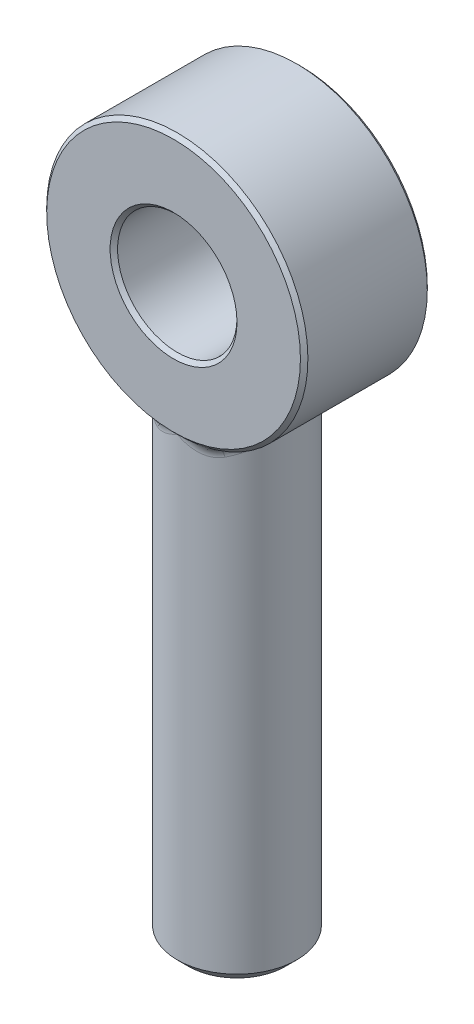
ISO-10303-21;
HEADER;
FILE_DESCRIPTION(('STEP AP214'),'2;1');
FILE_NAME('part.step','',(''),(''),'','','');
FILE_SCHEMA(('AUTOMOTIVE_DESIGN { 1 0 10303 214 1 1 1 1 }'));
ENDSEC;
DATA;
#1=APPLICATION_CONTEXT('core data for automotive mechanical design processes');
#2=APPLICATION_PROTOCOL_DEFINITION('international standard','automotive_design',2000,#1);
#3=PRODUCT_CONTEXT('',#1,'mechanical');
#4=PRODUCT('Part','Part','',(#3));
#5=PRODUCT_RELATED_PRODUCT_CATEGORY('part','',(#4));
#6=PRODUCT_DEFINITION_FORMATION('','',#4);
#7=PRODUCT_DEFINITION_CONTEXT('part definition',#1,'design');
#8=PRODUCT_DEFINITION('design','',#6,#7);
#9=PRODUCT_DEFINITION_SHAPE('','',#8);
#10=(LENGTH_UNIT() NAMED_UNIT(*) SI_UNIT(.MILLI.,.METRE.));
#11=(NAMED_UNIT(*) PLANE_ANGLE_UNIT() SI_UNIT($,.RADIAN.));
#12=(NAMED_UNIT(*) SI_UNIT($,.STERADIAN.) SOLID_ANGLE_UNIT());
#13=UNCERTAINTY_MEASURE_WITH_UNIT(LENGTH_MEASURE(1.E-05),#10,'distance_accuracy_value','');
#14=(GEOMETRIC_REPRESENTATION_CONTEXT(3) GLOBAL_UNCERTAINTY_ASSIGNED_CONTEXT((#13)) GLOBAL_UNIT_ASSIGNED_CONTEXT((#10,
#11,#12)) REPRESENTATION_CONTEXT('',''));
#15=CARTESIAN_POINT('',(0.,0.,0.));
#16=DIRECTION('',(0.,0.,1.));
#17=DIRECTION('',(1.,0.,0.));
#18=AXIS2_PLACEMENT_3D('',#15,#16,#17);
#19=CARTESIAN_POINT('',(0.,0.,-8.5));
#20=DIRECTION('',(0.,0.,1.));
#21=DIRECTION('',(1.,0.,0.));
#22=AXIS2_PLACEMENT_3D('',#19,#20,#21);
#23=CYLINDRICAL_SURFACE('',#22,17.5);
#24=CARTESIAN_POINT('',(0.,0.,7.99999999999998));
#25=DIRECTION('',(0.,0.,1.));
#26=DIRECTION('',(1.,0.,0.));
#27=AXIS2_PLACEMENT_3D('',#24,#25,#26);
#28=CIRCLE('',#27,17.5);
#29=CARTESIAN_POINT('',(-5.38461538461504,-16.6510034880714,7.99999999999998));
#30=VERTEX_POINT('',#29);
#31=CARTESIAN_POINT('',(5.3846153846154,-16.6510034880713,7.99999999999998));
#32=VERTEX_POINT('',#31);
#33=EDGE_CURVE('E101',#30,#32,#28,.F.);
#34=ORIENTED_EDGE('',*,*,#33,.T.);
#35=CARTESIAN_POINT('',(2.86139697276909,-17.2644839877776,9.47808090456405));
#36=CARTESIAN_POINT('',(2.27151511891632,-17.3622503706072,7.67639257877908));
#37=CARTESIAN_POINT('',(2.55073101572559,-19.237567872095,7.58246472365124));
#38=CARTESIAN_POINT('',(3.09034256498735,-17.2265668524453,9.39228340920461));
#39=CARTESIAN_POINT('',(2.45963332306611,-17.339092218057,7.62141529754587));
#40=CARTESIAN_POINT('',(2.75481965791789,-19.1953173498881,7.51382672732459));
#41=CARTESIAN_POINT('',(3.31549393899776,-17.1845441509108,9.29640180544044));
#42=CARTESIAN_POINT('',(2.64797711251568,-17.3128213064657,7.55889608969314));
#43=CARTESIAN_POINT('',(2.95552602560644,-19.1484920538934,7.43712144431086));
#44=CARTESIAN_POINT('',(3.75684222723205,-17.093467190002,9.08554841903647));
#45=CARTESIAN_POINT('',(3.02236020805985,-17.2543679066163,7.41843886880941));
#46=CARTESIAN_POINT('',(3.34895649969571,-19.0470062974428,7.26843873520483));
#47=CARTESIAN_POINT('',(3.97304460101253,-17.0444173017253,8.97058849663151));
#48=CARTESIAN_POINT('',(3.20819238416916,-17.2222787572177,7.34073694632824));
#49=CARTESIAN_POINT('',(3.54168547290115,-18.9923507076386,7.1764707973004));
#50=CARTESIAN_POINT('',(4.39492563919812,-16.9405363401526,8.72283539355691));
#51=CARTESIAN_POINT('',(3.57598505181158,-17.1525401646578,7.1697494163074));
#52=CARTESIAN_POINT('',(3.91776228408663,-18.8765976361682,6.97826831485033));
#53=CARTESIAN_POINT('',(4.60062755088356,-16.8857189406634,8.59008419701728));
#54=CARTESIAN_POINT('',(3.75782058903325,-17.1149917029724,7.07673535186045));
#55=CARTESIAN_POINT('',(4.10113084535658,-18.8155153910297,6.87206735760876));
#56=CARTESIAN_POINT('',(5.00104466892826,-16.7714926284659,8.30758625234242));
#57=CARTESIAN_POINT('',(4.11640575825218,-17.0349041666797,6.87497027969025));
#58=CARTESIAN_POINT('',(4.45807410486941,-18.6882346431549,6.64606900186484));
#59=CARTESIAN_POINT('',(5.19575761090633,-16.7120827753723,8.15783602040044));
#60=CARTESIAN_POINT('',(4.29310660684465,-16.9924394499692,6.7664393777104));
#61=CARTESIAN_POINT('',(4.63164678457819,-18.6220350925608,6.52626881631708));
#62=CARTESIAN_POINT('',(5.79743157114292,-16.5174928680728,7.65499294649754));
#63=CARTESIAN_POINT('',(4.84224193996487,-16.8511810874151,6.3978153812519));
#64=CARTESIAN_POINT('',(5.1679961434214,-18.405206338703,6.12399435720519));
#65=CARTESIAN_POINT('',(6.18227192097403,-16.3760057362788,7.2713522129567));
#66=CARTESIAN_POINT('',(5.20623622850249,-16.7437540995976,6.1069384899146));
#67=CARTESIAN_POINT('',(5.51105382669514,-18.2475492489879,5.81708177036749));
#68=CARTESIAN_POINT('',(6.88782443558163,-16.0920182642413,6.43613113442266));
#69=CARTESIAN_POINT('',(5.88533461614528,-16.5201565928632,5.4527103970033));
#70=CARTESIAN_POINT('',(6.14000349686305,-17.9311060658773,5.14890490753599));
#71=CARTESIAN_POINT('',(7.20844840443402,-15.9495168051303,5.98445882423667));
#72=CARTESIAN_POINT('',(6.20193970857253,-16.4040200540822,5.09045566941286));
#73=CARTESIAN_POINT('',(6.4258168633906,-17.7723187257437,4.78756705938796));
#74=CARTESIAN_POINT('',(7.63541156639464,-15.7472374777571,5.2627859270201));
#75=CARTESIAN_POINT('',(6.62963608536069,-16.234806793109,4.49655333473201));
#76=CARTESIAN_POINT('',(6.80642402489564,-17.5469217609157,4.21022874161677));
#77=CARTESIAN_POINT('',(7.76893723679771,-15.6816105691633,5.01435824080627));
#78=CARTESIAN_POINT('',(6.76391196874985,-16.1794533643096,4.29119566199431));
#79=CARTESIAN_POINT('',(6.92545262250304,-17.4737946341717,4.01148659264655));
#80=CARTESIAN_POINT('',(8.01672650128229,-15.5563922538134,4.50410072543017));
#81=CARTESIAN_POINT('',(7.01418995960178,-16.0729521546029,3.86613176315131));
#82=CARTESIAN_POINT('',(7.14633905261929,-17.3342656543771,3.60328058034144));
#83=CARTESIAN_POINT('',(8.13099900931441,-15.4967980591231,4.24227717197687));
#84=CARTESIAN_POINT('',(7.13049502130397,-16.021708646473,3.64633288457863));
#85=CARTESIAN_POINT('',(7.24820483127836,-17.2678606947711,3.39382173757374));
#86=CARTESIAN_POINT('',(8.33909188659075,-15.3858201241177,3.70692980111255));
#87=CARTESIAN_POINT('',(7.3429269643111,-15.9256924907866,3.19422336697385));
#88=CARTESIAN_POINT('',(7.43370476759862,-17.1441995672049,2.96554384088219));
#89=CARTESIAN_POINT('',(8.43293058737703,-15.33442903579,3.43341673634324));
#90=CARTESIAN_POINT('',(7.43935879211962,-15.8808044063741,2.96173247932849));
#91=CARTESIAN_POINT('',(7.5173552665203,-17.0869352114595,2.7467333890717));
#92=CARTESIAN_POINT('',(8.59914617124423,-15.241842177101,2.87631772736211));
#93=CARTESIAN_POINT('',(7.61045567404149,-15.7996142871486,2.486172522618));
#94=CARTESIAN_POINT('',(7.66552458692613,-16.9837669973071,2.3010541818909));
#95=CARTESIAN_POINT('',(8.67152548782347,-15.2006452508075,2.59273292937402));
#96=CARTESIAN_POINT('',(7.6853814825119,-15.763199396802,2.24282238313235));
#97=CARTESIAN_POINT('',(7.73004557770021,-16.9378618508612,2.07418634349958));
#98=CARTESIAN_POINT('',(8.78953062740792,-15.1326951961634,2.03770167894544));
#99=CARTESIAN_POINT('',(7.80761890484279,-15.7030083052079,1.76518094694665));
#100=CARTESIAN_POINT('',(7.83523873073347,-16.8621460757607,1.63016134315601));
#101=CARTESIAN_POINT('',(8.8366622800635,-15.1051392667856,1.76677499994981));
#102=CARTESIAN_POINT('',(7.85664046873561,-15.6784578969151,1.53119634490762));
#103=CARTESIAN_POINT('',(7.87725323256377,-16.8314408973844,1.41341999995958));
#104=CARTESIAN_POINT('',(8.91073034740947,-15.0615651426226,1.22036936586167));
#105=CARTESIAN_POINT('',(7.93364888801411,-15.6396221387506,1.05868692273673));
#106=CARTESIAN_POINT('',(7.94327962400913,-16.7828868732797,0.976295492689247));
#107=CARTESIAN_POINT('',(8.93766801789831,-15.04554623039,0.944890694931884));
#108=CARTESIAN_POINT('',(7.96175306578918,-15.6252785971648,0.819822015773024));
#109=CARTESIAN_POINT('',(7.96729263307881,-16.7650372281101,0.755912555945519));
#110=CARTESIAN_POINT('',(8.97090457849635,-15.0257528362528,0.392021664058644));
#111=CARTESIAN_POINT('',(7.99638411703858,-15.6075751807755,0.340378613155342));
#112=CARTESIAN_POINT('',(7.99692065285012,-16.7429817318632,0.313617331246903));
#113=CARTESIAN_POINT('',(8.97721672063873,-15.0219704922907,0.114632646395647));
#114=CARTESIAN_POINT('',(8.00297869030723,-15.6041807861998,0.0994320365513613));
#115=CARTESIAN_POINT('',(8.00254747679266,-16.7387671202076,0.0917061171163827));
#116=CARTESIAN_POINT('',(8.96913124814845,-15.0267997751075,-0.439634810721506));
#117=CARTESIAN_POINT('',(7.99454931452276,-15.6085039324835,-0.38153741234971));
#118=CARTESIAN_POINT('',(7.99533985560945,-16.744148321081,-0.351707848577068));
#119=CARTESIAN_POINT('',(8.95473437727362,-15.0354109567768,-0.716513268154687));
#120=CARTESIAN_POINT('',(7.97951293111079,-15.6162278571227,-0.621936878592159));
#121=CARTESIAN_POINT('',(7.98250607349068,-16.7537436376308,-0.573210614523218));
#122=CARTESIAN_POINT('',(8.90838559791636,-15.0629106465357,-1.23468720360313));
#123=CARTESIAN_POINT('',(7.9312579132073,-15.6407942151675,-1.07086790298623));
#124=CARTESIAN_POINT('',(7.94118944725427,-16.7843861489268,-0.987749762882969));
#125=CARTESIAN_POINT('',(8.87870387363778,-15.0804675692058,-1.47632873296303));
#126=CARTESIAN_POINT('',(7.90033058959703,-15.6564852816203,-1.28012164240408));
#127=CARTESIAN_POINT('',(7.91473031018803,-16.8039495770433,-1.18106298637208));
#128=CARTESIAN_POINT('',(8.80379777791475,-15.1243190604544,-1.95552860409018));
#129=CARTESIAN_POINT('',(7.82251846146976,-15.6955129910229,-1.69404112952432));
#130=CARTESIAN_POINT('',(7.84795687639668,-16.852812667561,-1.56442288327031));
#131=CARTESIAN_POINT('',(8.75857751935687,-15.1506113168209,-2.19308800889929));
#132=CARTESIAN_POINT('',(7.77554806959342,-15.718891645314,-1.8989332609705));
#133=CARTESIAN_POINT('',(7.80764624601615,-16.8821097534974,-1.75447040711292));
#134=CARTESIAN_POINT('',(8.65308089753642,-15.2111104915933,-2.6627726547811));
#135=CARTESIAN_POINT('',(7.66636693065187,-15.7724088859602,-2.30267286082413));
#136=CARTESIAN_POINT('',(7.71360354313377,-16.9495231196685,-2.13021812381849));
#137=CARTESIAN_POINT('',(8.59280226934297,-15.2453186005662,-2.89489707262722));
#138=CARTESIAN_POINT('',(7.60403445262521,-15.8026042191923,-2.50171382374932));
#139=CARTESIAN_POINT('',(7.65986945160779,-16.9876407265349,-2.31591765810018));
#140=CARTESIAN_POINT('',(8.45775691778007,-15.3206499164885,-3.35255101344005));
#141=CARTESIAN_POINT('',(7.46498677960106,-15.8686932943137,-2.89252592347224));
#142=CARTESIAN_POINT('',(7.53948616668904,-17.071581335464,-2.68204081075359));
#143=CARTESIAN_POINT('',(8.38297963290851,-15.3617781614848,-3.57807559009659));
#144=CARTESIAN_POINT('',(7.38811970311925,-15.9046526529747,-3.08444841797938));
#145=CARTESIAN_POINT('',(7.4728275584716,-17.1174099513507,-2.86246047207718));
#146=CARTESIAN_POINT('',(8.13065226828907,-15.4977462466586,-4.26248504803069));
#147=CARTESIAN_POINT('',(7.12916084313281,-16.0230505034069,-3.66578769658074));
#148=CARTESIAN_POINT('',(7.24789573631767,-17.2689172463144,-3.40998803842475));
#149=CARTESIAN_POINT('',(7.92974685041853,-15.6023722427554,-4.70854182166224));
#150=CARTESIAN_POINT('',(6.92419265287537,-16.113143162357,-4.03993102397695));
#151=CARTESIAN_POINT('',(7.06880290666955,-17.3855004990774,-3.76683345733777));
#152=CARTESIAN_POINT('',(7.47306213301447,-15.8261733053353,-5.55922173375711));
#153=CARTESIAN_POINT('',(6.46580882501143,-16.3015643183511,-4.74293472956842));
#154=CARTESIAN_POINT('',(6.66170110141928,-17.6348788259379,-4.44737738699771));
#155=CARTESIAN_POINT('',(7.21726638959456,-15.9453527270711,-5.96383240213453));
#156=CARTESIAN_POINT('',(6.21090969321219,-16.4003058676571,-5.07205569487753));
#157=CARTESIAN_POINT('',(6.43367746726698,-17.7676787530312,-4.77106592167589));
#158=CARTESIAN_POINT('',(6.82288252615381,-16.1156358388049,-6.49922240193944));
#159=CARTESIAN_POINT('',(5.82762258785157,-16.5369280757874,-5.4972416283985));
#160=CARTESIAN_POINT('',(6.08211242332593,-17.9574227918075,-5.19937792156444));
#161=CARTESIAN_POINT('',(6.7048933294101,-16.1651389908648,-6.64993366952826));
#162=CARTESIAN_POINT('',(5.71298132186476,-16.5764567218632,-5.61656363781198));
#163=CARTESIAN_POINT('',(5.97693348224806,-18.012583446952,-5.31994693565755));
#164=CARTESIAN_POINT('',(6.46113452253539,-16.2641026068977,-6.94308181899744));
#165=CARTESIAN_POINT('',(5.47791055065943,-16.6546059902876,-5.84669941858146));
#166=CARTESIAN_POINT('',(5.75963991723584,-18.1228571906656,-5.55446545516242));
#167=CARTESIAN_POINT('',(6.3353719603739,-16.3135630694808,-7.08552597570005));
#168=CARTESIAN_POINT('',(5.35741792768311,-16.6932273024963,-5.95747341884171));
#169=CARTESIAN_POINT('',(5.64753157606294,-18.1779702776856,-5.66842078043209));
#170=CARTESIAN_POINT('',(5.94680085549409,-16.4609276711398,-7.49998896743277));
#171=CARTESIAN_POINT('',(4.98669870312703,-16.8073317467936,-6.27806058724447));
#172=CARTESIAN_POINT('',(5.30114819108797,-18.3421765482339,-5.99999117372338));
#173=CARTESIAN_POINT('',(5.67253562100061,-16.5578914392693,-7.75937346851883));
#174=CARTESIAN_POINT('',(4.72978495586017,-16.8801244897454,-6.47330998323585));
#175=CARTESIAN_POINT('',(5.05666032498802,-18.4502218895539,-6.20749877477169));
#176=CARTESIAN_POINT('',(5.19596520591,-16.7120120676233,-8.15766254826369));
#177=CARTESIAN_POINT('',(4.29331716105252,-16.9923751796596,-6.76629512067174));
#178=CARTESIAN_POINT('',(4.63183184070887,-18.6219563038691,-6.52613003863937));
#179=CARTESIAN_POINT('',(5.00145281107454,-16.7713670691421,-8.30727213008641));
#180=CARTESIAN_POINT('',(4.11678306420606,-17.034810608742,-6.87473727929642));
#181=CARTESIAN_POINT('',(4.45843793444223,-18.6880947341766,-6.64581770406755));
#182=CARTESIAN_POINT('',(4.60143401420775,-16.8854979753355,-8.5895413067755));
#183=CARTESIAN_POINT('',(3.75853455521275,-17.1148415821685,-7.07635445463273));
#184=CARTESIAN_POINT('',(4.10184974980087,-18.815269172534,-6.87163304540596));
#185=CARTESIAN_POINT('',(4.39592794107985,-16.9402740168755,-8.72220140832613));
#186=CARTESIAN_POINT('',(3.57686844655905,-17.1523618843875,-7.16930687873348));
#187=CARTESIAN_POINT('',(3.91865576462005,-18.8763053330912,-6.97776112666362));
#188=CARTESIAN_POINT('',(3.97405016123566,-17.0441851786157,-8.97004326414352));
#189=CARTESIAN_POINT('',(3.20905897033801,-17.2221253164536,-7.34036624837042));
#190=CARTESIAN_POINT('',(3.5425818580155,-18.9920920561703,-7.1760346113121));
#191=CARTESIAN_POINT('',(3.75763616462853,-17.0932954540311,-9.08514870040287));
#192=CARTESIAN_POINT('',(3.02303707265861,-17.254256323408,-7.41817055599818));
#193=CARTESIAN_POINT('',(3.34966423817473,-19.0468149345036,-7.26811896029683));
#194=CARTESIAN_POINT('',(3.3158828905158,-17.1844718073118,-9.29623638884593));
#195=CARTESIAN_POINT('',(2.64829998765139,-17.3127768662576,-7.55878939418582));
#196=CARTESIAN_POINT('',(2.95587274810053,-19.1484114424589,-7.43698911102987));
#197=CARTESIAN_POINT('',(3.0905396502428,-17.2265347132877,-9.39221003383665));
#198=CARTESIAN_POINT('',(2.45979256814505,-17.3390738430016,-7.62136987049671));
#199=CARTESIAN_POINT('',(2.75499534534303,-19.1952815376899,-7.5137680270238));
#200=CARTESIAN_POINT('',(2.86139697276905,-17.2644839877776,-9.47808090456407));
#201=CARTESIAN_POINT('',(2.27151511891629,-17.3622503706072,-7.67639257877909));
#202=CARTESIAN_POINT('',(2.55073101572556,-19.237567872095,-7.58246472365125));
#203=(BOUNDED_SURFACE() B_SPLINE_SURFACE(3,2,((#35,#36,#37),(#38,#39,#40),(#41,#42,#43),(#44,
#45,#46),(#47,#48,#49),(#50,#51,#52),(#53,#54,#55),(#56,#57,#58),(#59,#60,#61),(#62,#63,#64),
(#65,#66,#67),(#68,#69,#70),(#71,#72,#73),(#74,#75,#76),(#77,#78,#79),(#80,#81,#82),(#83,#84,
#85),(#86,#87,#88),(#89,#90,#91),(#92,#93,#94),(#95,#96,#97),(#98,#99,#100),(#101,#102,#103),
(#104,#105,#106),(#107,#108,#109),(#110,#111,#112),(#113,#114,#115),(#116,#117,#118),(#119,#120,
#121),(#122,#123,#124),(#125,#126,#127),(#128,#129,#130),(#131,#132,#133),(#134,#135,#136),
(#137,#138,#139),(#140,#141,#142),(#143,#144,#145),(#146,#147,#148),(#149,#150,#151),(#152,#153,
#154),(#155,#156,#157),(#158,#159,#160),(#161,#162,#163),(#164,#165,#166),(#167,#168,#169),
(#170,#171,#172),(#173,#174,#175),(#176,#177,#178),(#179,#180,#181),(#182,#183,#184),(#185,#186,
#187),(#188,#189,#190),(#191,#192,#193),(#194,#195,#196),(#197,#198,#199),(#200,#201,#202)),
.UNSPECIFIED.,.F.,.F.,.F.) B_SPLINE_SURFACE_WITH_KNOTS((4,2,2,2,2,2,2,2,2,2,2,2,2,2,2,2,2,2,2,2,
2,2,2,2,2,2,2,4),(3,3),(0.,0.816977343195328,1.63344869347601,2.44802617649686,3.26277090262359,
5.04368679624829,6.82703210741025,7.72207945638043,8.61671126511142,9.51053714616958,
10.4042616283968,11.2360823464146,12.0678513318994,12.8990857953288,13.7302904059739,
14.4634831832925,15.1964820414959,15.9295912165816,16.663236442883,18.1944051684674,
19.7260332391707,20.3481507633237,20.9697122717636,22.2118929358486,23.0257905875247,
23.8396639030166,24.6569803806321,25.4746637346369),(0.,1.),
.UNSPECIFIED.) GEOMETRIC_REPRESENTATION_ITEM() RATIONAL_B_SPLINE_SURFACE(((1.,0.725304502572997,
1.),(1.,0.728178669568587,1.),(1.,0.731335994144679,1.),(1.,0.738099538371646,1.),(1.,
0.741705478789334,1.),(1.,0.749243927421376,1.),(1.,0.753175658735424,1.),(1.,0.761258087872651,
1.),(1.,0.765408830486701,1.),(1.,0.778810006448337,1.),(1.,0.788270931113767,1.),(1.,
0.806676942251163,1.),(1.,0.815621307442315,1.),(1.,0.827985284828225,1.),(1.,0.831937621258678,
1.),(1.,0.839388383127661,1.),(1.,0.842887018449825,1.),(1.,0.849335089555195,1.),(1.,
0.852285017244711,1.),(1.,0.857556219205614,1.),(1.,0.859877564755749,1.),(1.,0.86368424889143,
1.),(1.,0.865216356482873,1.),(1.,0.867631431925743,1.),(1.,0.868514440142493,1.),(1.,
0.869604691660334,1.),(1.,0.869812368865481,1.),(1.,0.869546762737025,1.),(1.,0.86907350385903,
1.),(1.,0.867555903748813,1.),(1.,0.86658548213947,1.),(1.,0.864149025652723,1.),(1.,
0.8626831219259,1.),(1.,0.859286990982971,1.),(1.,0.85735669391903,1.),(1.,0.853070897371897,
1.),(1.,0.850715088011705,1.),(1.,0.842852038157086,1.),(1.,0.836702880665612,1.),(1.,
0.823211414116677,1.),(1.,0.815868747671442,1.),(1.,0.805092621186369,1.),(1.,0.801926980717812,
1.),(1.,0.795530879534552,1.),(1.,0.792300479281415,1.),(1.,0.782570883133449,1.),(1.,
0.776028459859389,1.),(1.,0.76541327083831,1.),(1.,0.761266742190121,1.),(1.,0.753191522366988,
1.),(1.,0.749262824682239,1.),(1.,0.741722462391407,1.),(1.,0.738112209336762,1.),(1.,
0.731341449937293,1.),(1.,0.728181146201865,1.),(1.,0.725304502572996,1.))) REPRESENTATION_ITEM('') SURFACE());
#204=CARTESIAN_POINT('',(2.86139697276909,-17.2644839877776,9.47808090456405));
#205=CARTESIAN_POINT('',(3.09034256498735,-17.2265668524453,9.39228340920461));
#206=CARTESIAN_POINT('',(3.31549393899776,-17.1845441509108,9.29640180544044));
#207=CARTESIAN_POINT('',(3.75684222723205,-17.093467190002,9.08554841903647));
#208=CARTESIAN_POINT('',(3.97304460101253,-17.0444173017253,8.97058849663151));
#209=CARTESIAN_POINT('',(4.39492563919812,-16.9405363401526,8.72283539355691));
#210=CARTESIAN_POINT('',(4.60062755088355,-16.8857189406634,8.59008419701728));
#211=CARTESIAN_POINT('',(5.00104466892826,-16.7714926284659,8.30758625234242));
#212=CARTESIAN_POINT('',(5.19575761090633,-16.7120827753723,8.15783602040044));
#213=CARTESIAN_POINT('',(5.79743157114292,-16.5174928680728,7.65499294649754));
#214=CARTESIAN_POINT('',(6.18227192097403,-16.3760057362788,7.2713522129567));
#215=CARTESIAN_POINT('',(6.88782443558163,-16.0920182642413,6.43613113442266));
#216=CARTESIAN_POINT('',(7.20844840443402,-15.9495168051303,5.98445882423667));
#217=CARTESIAN_POINT('',(7.63541156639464,-15.7472374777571,5.2627859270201));
#218=CARTESIAN_POINT('',(7.76893723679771,-15.6816105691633,5.01435824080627));
#219=CARTESIAN_POINT('',(8.01672650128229,-15.5563922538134,4.50410072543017));
#220=CARTESIAN_POINT('',(8.13099900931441,-15.4967980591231,4.24227717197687));
#221=CARTESIAN_POINT('',(8.33909188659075,-15.3858201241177,3.70692980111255));
#222=CARTESIAN_POINT('',(8.43293058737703,-15.33442903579,3.43341673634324));
#223=CARTESIAN_POINT('',(8.59914617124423,-15.241842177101,2.87631772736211));
#224=CARTESIAN_POINT('',(8.67152548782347,-15.2006452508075,2.59273292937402));
#225=CARTESIAN_POINT('',(8.78953062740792,-15.1326951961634,2.03770167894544));
#226=CARTESIAN_POINT('',(8.8366622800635,-15.1051392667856,1.76677499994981));
#227=CARTESIAN_POINT('',(8.91073034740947,-15.0615651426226,1.22036936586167));
#228=CARTESIAN_POINT('',(8.9376680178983,-15.04554623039,0.944890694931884));
#229=CARTESIAN_POINT('',(8.97090457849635,-15.0257528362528,0.392021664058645));
#230=CARTESIAN_POINT('',(8.97721672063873,-15.0219704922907,0.114632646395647));
#231=CARTESIAN_POINT('',(8.96913124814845,-15.0267997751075,-0.439634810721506));
#232=CARTESIAN_POINT('',(8.95473437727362,-15.0354109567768,-0.716513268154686));
#233=CARTESIAN_POINT('',(8.90838559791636,-15.0629106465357,-1.23468720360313));
#234=CARTESIAN_POINT('',(8.87870387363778,-15.0804675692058,-1.47632873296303));
#235=CARTESIAN_POINT('',(8.80379777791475,-15.1243190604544,-1.95552860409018));
#236=CARTESIAN_POINT('',(8.75857751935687,-15.1506113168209,-2.19308800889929));
#237=CARTESIAN_POINT('',(8.65308089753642,-15.2111104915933,-2.6627726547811));
#238=CARTESIAN_POINT('',(8.59280226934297,-15.2453186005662,-2.89489707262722));
#239=CARTESIAN_POINT('',(8.45775691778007,-15.3206499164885,-3.35255101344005));
#240=CARTESIAN_POINT('',(8.38297963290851,-15.3617781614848,-3.57807559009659));
#241=CARTESIAN_POINT('',(8.13065226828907,-15.4977462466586,-4.26248504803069));
#242=CARTESIAN_POINT('',(7.92974685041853,-15.6023722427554,-4.70854182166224));
#243=CARTESIAN_POINT('',(7.47306213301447,-15.8261733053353,-5.55922173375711));
#244=CARTESIAN_POINT('',(7.21726638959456,-15.9453527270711,-5.96383240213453));
#245=CARTESIAN_POINT('',(6.82288252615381,-16.1156358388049,-6.49922240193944));
#246=CARTESIAN_POINT('',(6.7048933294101,-16.1651389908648,-6.64993366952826));
#247=CARTESIAN_POINT('',(6.46113452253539,-16.2641026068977,-6.94308181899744));
#248=CARTESIAN_POINT('',(6.3353719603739,-16.3135630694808,-7.08552597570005));
#249=CARTESIAN_POINT('',(5.94680085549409,-16.4609276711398,-7.49998896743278));
#250=CARTESIAN_POINT('',(5.67253562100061,-16.5578914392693,-7.75937346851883));
#251=CARTESIAN_POINT('',(5.19596520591,-16.7120120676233,-8.15766254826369));
#252=CARTESIAN_POINT('',(5.00145281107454,-16.7713670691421,-8.30727213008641));
#253=CARTESIAN_POINT('',(4.60143401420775,-16.8854979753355,-8.5895413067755));
#254=CARTESIAN_POINT('',(4.39592794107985,-16.9402740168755,-8.72220140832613));
#255=CARTESIAN_POINT('',(3.97405016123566,-17.0441851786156,-8.97004326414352));
#256=CARTESIAN_POINT('',(3.75763616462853,-17.0932954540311,-9.08514870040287));
#257=CARTESIAN_POINT('',(3.3158828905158,-17.1844718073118,-9.29623638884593));
#258=CARTESIAN_POINT('',(3.09053965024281,-17.2265347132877,-9.39221003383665));
#259=CARTESIAN_POINT('',(2.86139697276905,-17.2644839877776,-9.47808090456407));
#260=B_SPLINE_CURVE_WITH_KNOTS('',3,(#204,#205,#206,#207,#208,#209,#210,#211,#212,#213,#214,
#215,#216,#217,#218,#219,#220,#221,#222,#223,#224,#225,#226,#227,#228,#229,#230,#231,#232,#233,
#234,#235,#236,#237,#238,#239,#240,#241,#242,#243,#244,#245,#246,#247,#248,#249,#250,#251,#252,
#253,#254,#255,#256,#257,#258,#259),.UNSPECIFIED.,.F.,.F.,(4,2,2,2,2,2,2,2,2,2,2,2,2,2,2,2,2,2,
2,2,2,2,2,2,2,2,2,4),(0.,0.816977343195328,1.63344869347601,2.44802617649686,3.26277090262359,
5.04368679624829,6.82703210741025,7.72207945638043,8.61671126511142,9.51053714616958,
10.4042616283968,11.2360823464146,12.0678513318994,12.8990857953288,13.7302904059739,
14.4634831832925,15.1964820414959,15.9295912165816,16.663236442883,18.1944051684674,
19.7260332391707,20.3481507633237,20.9697122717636,22.2118929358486,23.0257905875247,
23.8396639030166,24.6569803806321,25.4746637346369),.UNSPECIFIED.);
#261=CARTESIAN_POINT('',(5.38461538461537,-16.6510034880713,-8.00000000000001));
#262=VERTEX_POINT('',#261);
#263=EDGE_CURVE('E11',#32,#262,#260,.T.);
#264=ORIENTED_EDGE('',*,*,#263,.T.);
#265=CARTESIAN_POINT('',(0.,0.,-8.00000000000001));
#266=DIRECTION('',(0.,0.,1.));
#267=DIRECTION('',(1.,0.,0.));
#268=AXIS2_PLACEMENT_3D('',#265,#266,#267);
#269=CIRCLE('',#268,17.5);
#270=CARTESIAN_POINT('',(-5.38461538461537,-16.6510034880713,-8.00000000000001));
#271=VERTEX_POINT('',#270);
#272=EDGE_CURVE('E225',#262,#271,#269,.T.);
#273=ORIENTED_EDGE('',*,*,#272,.T.);
#274=CARTESIAN_POINT('',(-2.86139697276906,-17.2644839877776,-9.47808090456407));
#275=CARTESIAN_POINT('',(-2.27151511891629,-17.3622503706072,-7.67639257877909));
#276=CARTESIAN_POINT('',(-2.55073101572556,-19.237567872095,-7.58246472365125));
#277=CARTESIAN_POINT('',(-3.09034256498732,-17.2265668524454,-9.39228340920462));
#278=CARTESIAN_POINT('',(-2.45963332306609,-17.3390922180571,-7.62141529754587));
#279=CARTESIAN_POINT('',(-2.75481965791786,-19.1953173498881,-7.5138267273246));
#280=CARTESIAN_POINT('',(-3.31549393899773,-17.1845441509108,-9.29640180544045));
#281=CARTESIAN_POINT('',(-2.64797711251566,-17.3128213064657,-7.55889608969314));
#282=CARTESIAN_POINT('',(-2.95552602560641,-19.1484920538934,-7.43712144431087));
#283=CARTESIAN_POINT('',(-3.75684222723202,-17.093467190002,-9.08554841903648));
#284=CARTESIAN_POINT('',(-3.02236020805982,-17.2543679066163,-7.41843886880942));
#285=CARTESIAN_POINT('',(-3.34895649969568,-19.0470062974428,-7.26843873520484));
#286=CARTESIAN_POINT('',(-3.9730446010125,-17.0444173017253,-8.97058849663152));
#287=CARTESIAN_POINT('',(-3.20819238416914,-17.2222787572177,-7.34073694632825));
#288=CARTESIAN_POINT('',(-3.54168547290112,-18.9923507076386,-7.17647079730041));
#289=CARTESIAN_POINT('',(-4.3949256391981,-16.9405363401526,-8.72283539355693));
#290=CARTESIAN_POINT('',(-3.57598505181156,-17.1525401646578,-7.16974941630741));
#291=CARTESIAN_POINT('',(-3.91776228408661,-18.8765976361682,-6.97826831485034));
#292=CARTESIAN_POINT('',(-4.60062755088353,-16.8857189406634,-8.59008419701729));
#293=CARTESIAN_POINT('',(-3.75782058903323,-17.1149917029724,-7.07673535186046));
#294=CARTESIAN_POINT('',(-4.10113084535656,-18.8155153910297,-6.87206735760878));
#295=CARTESIAN_POINT('',(-5.00104466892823,-16.7714926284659,-8.30758625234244));
#296=CARTESIAN_POINT('',(-4.11640575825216,-17.0349041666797,-6.87497027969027));
#297=CARTESIAN_POINT('',(-4.45807410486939,-18.6882346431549,-6.64606900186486));
#298=CARTESIAN_POINT('',(-5.19575761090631,-16.7120827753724,-8.15783602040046));
#299=CARTESIAN_POINT('',(-4.29310660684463,-16.9924394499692,-6.76643937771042));
#300=CARTESIAN_POINT('',(-4.63164678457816,-18.6220350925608,-6.5262688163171));
#301=CARTESIAN_POINT('',(-5.7974315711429,-16.5174928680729,-7.65499294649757));
#302=CARTESIAN_POINT('',(-4.84224193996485,-16.8511810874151,-6.39781538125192));
#303=CARTESIAN_POINT('',(-5.16799614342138,-18.4052063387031,-6.12399435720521));
#304=CARTESIAN_POINT('',(-6.182271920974,-16.3760057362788,-7.27135221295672));
#305=CARTESIAN_POINT('',(-5.20623622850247,-16.7437540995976,-6.10693848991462));
#306=CARTESIAN_POINT('',(-5.51105382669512,-18.2475492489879,-5.81708177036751));
#307=CARTESIAN_POINT('',(-6.88782443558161,-16.0920182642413,-6.43613113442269));
#308=CARTESIAN_POINT('',(-5.88533461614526,-16.5201565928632,-5.45271039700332));
#309=CARTESIAN_POINT('',(-6.14000349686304,-17.9311060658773,-5.14890490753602));
#310=CARTESIAN_POINT('',(-7.208448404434,-15.9495168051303,-5.98445882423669));
#311=CARTESIAN_POINT('',(-6.20193970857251,-16.4040200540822,-5.09045566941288));
#312=CARTESIAN_POINT('',(-6.42581686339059,-17.7723187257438,-4.78756705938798));
#313=CARTESIAN_POINT('',(-7.63541156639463,-15.7472374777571,-5.26278592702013));
#314=CARTESIAN_POINT('',(-6.62963608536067,-16.234806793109,-4.49655333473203));
#315=CARTESIAN_POINT('',(-6.80642402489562,-17.5469217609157,-4.2102287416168));
#316=CARTESIAN_POINT('',(-7.76893723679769,-15.6816105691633,-5.0143582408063));
#317=CARTESIAN_POINT('',(-6.76391196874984,-16.1794533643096,-4.29119566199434));
#318=CARTESIAN_POINT('',(-6.92545262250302,-17.4737946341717,-4.01148659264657));
#319=CARTESIAN_POINT('',(-8.01672650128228,-15.5563922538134,-4.5041007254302));
#320=CARTESIAN_POINT('',(-7.01418995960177,-16.0729521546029,-3.86613176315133));
#321=CARTESIAN_POINT('',(-7.14633905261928,-17.3342656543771,-3.60328058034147));
#322=CARTESIAN_POINT('',(-8.1309990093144,-15.4967980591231,-4.2422771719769));
#323=CARTESIAN_POINT('',(-7.13049502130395,-16.021708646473,-3.64633288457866));
#324=CARTESIAN_POINT('',(-7.24820483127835,-17.2678606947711,-3.39382173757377));
#325=CARTESIAN_POINT('',(-8.33909188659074,-15.3858201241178,-3.70692980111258));
#326=CARTESIAN_POINT('',(-7.34292696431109,-15.9256924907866,-3.19422336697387));
#327=CARTESIAN_POINT('',(-7.43370476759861,-17.1441995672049,-2.96554384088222));
#328=CARTESIAN_POINT('',(-8.43293058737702,-15.33442903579,-3.43341673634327));
#329=CARTESIAN_POINT('',(-7.43935879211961,-15.8808044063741,-2.96173247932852));
#330=CARTESIAN_POINT('',(-7.51735526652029,-17.0869352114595,-2.74673338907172));
#331=CARTESIAN_POINT('',(-8.59914617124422,-15.241842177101,-2.87631772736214));
#332=CARTESIAN_POINT('',(-7.61045567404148,-15.7996142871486,-2.48617252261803));
#333=CARTESIAN_POINT('',(-7.66552458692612,-16.9837669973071,-2.30105418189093));
#334=CARTESIAN_POINT('',(-8.67152548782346,-15.2006452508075,-2.59273292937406));
#335=CARTESIAN_POINT('',(-7.68538148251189,-15.763199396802,-2.24282238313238));
#336=CARTESIAN_POINT('',(-7.7300455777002,-16.9378618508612,-2.07418634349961));
#337=CARTESIAN_POINT('',(-8.78953062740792,-15.1326951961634,-2.03770167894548));
#338=CARTESIAN_POINT('',(-7.80761890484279,-15.7030083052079,-1.76518094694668));
#339=CARTESIAN_POINT('',(-7.83523873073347,-16.8621460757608,-1.63016134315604));
#340=CARTESIAN_POINT('',(-8.8366622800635,-15.1051392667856,-1.76677499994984));
#341=CARTESIAN_POINT('',(-7.8566404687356,-15.6784578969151,-1.53119634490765));
#342=CARTESIAN_POINT('',(-7.87725323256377,-16.8314408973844,-1.41341999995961));
#343=CARTESIAN_POINT('',(-8.91073034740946,-15.0615651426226,-1.2203693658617));
#344=CARTESIAN_POINT('',(-7.93364888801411,-15.6396221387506,-1.05868692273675));
#345=CARTESIAN_POINT('',(-7.94327962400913,-16.7828868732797,-0.976295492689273));
#346=CARTESIAN_POINT('',(-8.9376680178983,-15.04554623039,-0.944890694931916));
#347=CARTESIAN_POINT('',(-7.96175306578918,-15.6252785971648,-0.819822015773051));
#348=CARTESIAN_POINT('',(-7.96729263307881,-16.7650372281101,-0.755912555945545));
#349=CARTESIAN_POINT('',(-8.97090457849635,-15.0257528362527,-0.392021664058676));
#350=CARTESIAN_POINT('',(-7.99638411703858,-15.6075751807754,-0.34037861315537));
#351=CARTESIAN_POINT('',(-7.99692065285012,-16.7429817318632,-0.313617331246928));
#352=CARTESIAN_POINT('',(-8.97721672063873,-15.0219704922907,-0.114632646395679));
#353=CARTESIAN_POINT('',(-8.00297869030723,-15.6041807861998,-0.0994320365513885));
#354=CARTESIAN_POINT('',(-8.00254747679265,-16.7387671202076,-0.0917061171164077));
#355=CARTESIAN_POINT('',(-8.96913124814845,-15.0267997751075,0.439634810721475));
#356=CARTESIAN_POINT('',(-7.99454931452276,-15.6085039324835,0.381537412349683));
#357=CARTESIAN_POINT('',(-7.99533985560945,-16.744148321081,0.351707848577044));
#358=CARTESIAN_POINT('',(-8.95473437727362,-15.0354109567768,0.716513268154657));
#359=CARTESIAN_POINT('',(-7.97951293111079,-15.6162278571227,0.621936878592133));
#360=CARTESIAN_POINT('',(-7.98250607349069,-16.7537436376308,0.573210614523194));
#361=CARTESIAN_POINT('',(-8.90838559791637,-15.0629106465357,1.2346872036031));
#362=CARTESIAN_POINT('',(-7.9312579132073,-15.6407942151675,1.0708679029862));
#363=CARTESIAN_POINT('',(-7.94118944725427,-16.7843861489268,0.987749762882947));
#364=CARTESIAN_POINT('',(-8.87870387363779,-15.0804675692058,1.476328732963));
#365=CARTESIAN_POINT('',(-7.90033058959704,-15.6564852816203,1.28012164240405));
#366=CARTESIAN_POINT('',(-7.91473031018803,-16.8039495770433,1.18106298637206));
#367=CARTESIAN_POINT('',(-8.80379777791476,-15.1243190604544,1.95552860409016));
#368=CARTESIAN_POINT('',(-7.82251846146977,-15.6955129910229,1.69404112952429));
#369=CARTESIAN_POINT('',(-7.84795687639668,-16.852812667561,1.56442288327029));
#370=CARTESIAN_POINT('',(-8.75857751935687,-15.1506113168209,2.19308800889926));
#371=CARTESIAN_POINT('',(-7.77554806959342,-15.718891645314,1.89893326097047));
#372=CARTESIAN_POINT('',(-7.80764624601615,-16.8821097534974,1.7544704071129));
#373=CARTESIAN_POINT('',(-8.65308089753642,-15.2111104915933,2.66277265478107));
#374=CARTESIAN_POINT('',(-7.66636693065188,-15.7724088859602,2.3026728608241));
#375=CARTESIAN_POINT('',(-7.71360354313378,-16.9495231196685,2.13021812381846));
#376=CARTESIAN_POINT('',(-8.59280226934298,-15.2453186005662,2.89489707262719));
#377=CARTESIAN_POINT('',(-7.60403445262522,-15.8026042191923,2.5017138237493));
#378=CARTESIAN_POINT('',(-7.6598694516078,-16.9876407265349,2.31591765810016));
#379=CARTESIAN_POINT('',(-8.45775691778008,-15.3206499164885,3.35255101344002));
#380=CARTESIAN_POINT('',(-7.46498677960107,-15.8686932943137,2.89252592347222));
#381=CARTESIAN_POINT('',(-7.53948616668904,-17.071581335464,2.68204081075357));
#382=CARTESIAN_POINT('',(-8.38297963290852,-15.3617781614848,3.57807559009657));
#383=CARTESIAN_POINT('',(-7.38811970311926,-15.9046526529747,3.08444841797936));
#384=CARTESIAN_POINT('',(-7.47282755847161,-17.1174099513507,2.86246047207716));
#385=CARTESIAN_POINT('',(-8.13065226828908,-15.4977462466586,4.26248504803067));
#386=CARTESIAN_POINT('',(-7.12916084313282,-16.0230505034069,3.66578769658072));
#387=CARTESIAN_POINT('',(-7.24789573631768,-17.2689172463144,3.40998803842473));
#388=CARTESIAN_POINT('',(-7.92974685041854,-15.6023722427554,4.70854182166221));
#389=CARTESIAN_POINT('',(-6.92419265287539,-16.113143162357,4.03993102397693));
#390=CARTESIAN_POINT('',(-7.06880290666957,-17.3855004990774,3.76683345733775));
#391=CARTESIAN_POINT('',(-7.47306213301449,-15.8261733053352,5.55922173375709));
#392=CARTESIAN_POINT('',(-6.46580882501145,-16.3015643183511,4.7429347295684));
#393=CARTESIAN_POINT('',(-6.6617011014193,-17.6348788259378,4.44737738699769));
#394=CARTESIAN_POINT('',(-7.21726638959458,-15.9453527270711,5.96383240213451));
#395=CARTESIAN_POINT('',(-6.21090969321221,-16.4003058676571,5.07205569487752));
#396=CARTESIAN_POINT('',(-6.43367746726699,-17.7676787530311,4.77106592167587));
#397=CARTESIAN_POINT('',(-6.82288252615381,-16.1156358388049,6.49922240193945));
#398=CARTESIAN_POINT('',(-5.82762258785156,-16.5369280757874,5.49724162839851));
#399=CARTESIAN_POINT('',(-6.08211242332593,-17.9574227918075,5.19937792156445));
#400=CARTESIAN_POINT('',(-6.70489332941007,-16.1651389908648,6.64993366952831));
#401=CARTESIAN_POINT('',(-5.71298132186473,-16.5764567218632,5.61656363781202));
#402=CARTESIAN_POINT('',(-5.97693348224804,-18.0125834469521,5.31994693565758));
#403=CARTESIAN_POINT('',(-6.4611345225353,-16.2641026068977,6.94308181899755));
#404=CARTESIAN_POINT('',(-5.47791055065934,-16.6546059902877,5.84669941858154));
#405=CARTESIAN_POINT('',(-5.75963991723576,-18.1228571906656,5.55446545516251));
#406=CARTESIAN_POINT('',(-6.33537196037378,-16.3135630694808,7.08552597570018));
#407=CARTESIAN_POINT('',(-5.35741792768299,-16.6932273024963,5.95747341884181));
#408=CARTESIAN_POINT('',(-5.64753157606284,-18.1779702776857,5.6684207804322));
#409=CARTESIAN_POINT('',(-5.94680085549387,-16.4609276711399,7.49998896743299));
#410=CARTESIAN_POINT('',(-4.98669870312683,-16.8073317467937,6.27806058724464));
#411=CARTESIAN_POINT('',(-5.30114819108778,-18.342176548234,5.99999117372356));
#412=CARTESIAN_POINT('',(-5.67253562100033,-16.5578914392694,7.7593734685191));
#413=CARTESIAN_POINT('',(-4.72978495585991,-16.8801244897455,6.47330998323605));
#414=CARTESIAN_POINT('',(-5.05666032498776,-18.4502218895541,6.2074987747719));
#415=CARTESIAN_POINT('',(-5.19596520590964,-16.7120120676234,8.15766254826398));
#416=CARTESIAN_POINT('',(-4.29331716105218,-16.9923751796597,6.76629512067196));
#417=CARTESIAN_POINT('',(-4.63183184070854,-18.6219563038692,6.5261300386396));
#418=CARTESIAN_POINT('',(-5.00145281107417,-16.7713670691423,8.30727213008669));
#419=CARTESIAN_POINT('',(-4.11678306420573,-17.0348106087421,6.87473727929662));
#420=CARTESIAN_POINT('',(-4.4584379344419,-18.6880947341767,6.64581770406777));
#421=CARTESIAN_POINT('',(-4.60143401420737,-16.8854979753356,8.58954130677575));
#422=CARTESIAN_POINT('',(-3.75853455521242,-17.1148415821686,7.0763544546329));
#423=CARTESIAN_POINT('',(-4.10184974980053,-18.8152691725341,6.87163304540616));
#424=CARTESIAN_POINT('',(-4.39592794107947,-16.9402740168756,8.72220140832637));
#425=CARTESIAN_POINT('',(-3.57686844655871,-17.1523618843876,7.16930687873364));
#426=CARTESIAN_POINT('',(-3.91865576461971,-18.8763053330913,6.97776112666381));
#427=CARTESIAN_POINT('',(-3.97405016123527,-17.0441851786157,8.97004326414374));
#428=CARTESIAN_POINT('',(-3.20905897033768,-17.2221253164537,7.34036624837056));
#429=CARTESIAN_POINT('',(-3.54258185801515,-18.9920920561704,7.17603461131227));
#430=CARTESIAN_POINT('',(-3.75763616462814,-17.0932954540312,9.08514870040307));
#431=CARTESIAN_POINT('',(-3.02303707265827,-17.2542563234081,7.41817055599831));
#432=CARTESIAN_POINT('',(-3.34966423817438,-19.0468149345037,7.26811896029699));
#433=CARTESIAN_POINT('',(-3.3158828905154,-17.1844718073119,9.2962363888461));
#434=CARTESIAN_POINT('',(-2.64829998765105,-17.3127768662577,7.55878939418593));
#435=CARTESIAN_POINT('',(-2.95587274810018,-19.148411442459,7.43698911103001));
#436=CARTESIAN_POINT('',(-3.09053965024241,-17.2265347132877,9.39221003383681));
#437=CARTESIAN_POINT('',(-2.45979256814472,-17.3390738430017,7.62136987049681));
#438=CARTESIAN_POINT('',(-2.75499534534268,-19.1952815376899,7.51376802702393));
#439=CARTESIAN_POINT('',(-2.86139697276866,-17.2644839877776,9.47808090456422));
#440=CARTESIAN_POINT('',(-2.27151511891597,-17.3622503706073,7.67639257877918));
#441=CARTESIAN_POINT('',(-2.55073101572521,-19.2375678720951,7.58246472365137));
#442=(BOUNDED_SURFACE() B_SPLINE_SURFACE(3,2,((#274,#275,#276),(#277,#278,#279),(#280,#281,
#282),(#283,#284,#285),(#286,#287,#288),(#289,#290,#291),(#292,#293,#294),(#295,#296,#297),
(#298,#299,#300),(#301,#302,#303),(#304,#305,#306),(#307,#308,#309),(#310,#311,#312),(#313,#314,
#315),(#316,#317,#318),(#319,#320,#321),(#322,#323,#324),(#325,#326,#327),(#328,#329,#330),
(#331,#332,#333),(#334,#335,#336),(#337,#338,#339),(#340,#341,#342),(#343,#344,#345),(#346,#347,
#348),(#349,#350,#351),(#352,#353,#354),(#355,#356,#357),(#358,#359,#360),(#361,#362,#363),
(#364,#365,#366),(#367,#368,#369),(#370,#371,#372),(#373,#374,#375),(#376,#377,#378),(#379,#380,
#381),(#382,#383,#384),(#385,#386,#387),(#388,#389,#390),(#391,#392,#393),(#394,#395,#396),
(#397,#398,#399),(#400,#401,#402),(#403,#404,#405),(#406,#407,#408),(#409,#410,#411),(#412,#413,
#414),(#415,#416,#417),(#418,#419,#420),(#421,#422,#423),(#424,#425,#426),(#427,#428,#429),
(#430,#431,#432),(#433,#434,#435),(#436,#437,#438),(#439,#440,#441)),.UNSPECIFIED.,.F.,.F.,
.F.) B_SPLINE_SURFACE_WITH_KNOTS((4,2,2,2,2,2,2,2,2,2,2,2,2,2,2,2,2,2,2,2,2,2,2,2,2,2,2,4),(3,
3),(0.,0.816977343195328,1.63344869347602,2.44802617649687,3.26277090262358,5.04368679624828,
6.82703210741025,7.72207945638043,8.61671126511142,9.51053714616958,10.4042616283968,
11.2360823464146,12.0678513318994,12.8990857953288,13.7302904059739,14.4634831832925,
15.1964820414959,15.9295912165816,16.663236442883,18.1944051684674,19.7260332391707,
20.3481507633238,20.9697122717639,22.2118929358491,23.0257905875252,23.8396639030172,
24.6569803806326,25.4746637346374),(0.,1.),
.UNSPECIFIED.) GEOMETRIC_REPRESENTATION_ITEM() RATIONAL_B_SPLINE_SURFACE(((1.,0.725304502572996,
1.),(1.,0.728178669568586,1.),(1.,0.731335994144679,1.),(1.,0.738099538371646,1.),(1.,
0.741705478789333,1.),(1.,0.749243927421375,1.),(1.,0.753175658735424,1.),(1.,0.761258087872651,
1.),(1.,0.7654088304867,1.),(1.,0.778810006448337,1.),(1.,0.788270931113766,1.),(1.,
0.806676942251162,1.),(1.,0.815621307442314,1.),(1.,0.827985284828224,1.),(1.,0.831937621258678,
1.),(1.,0.83938838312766,1.),(1.,0.842887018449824,1.),(1.,0.849335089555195,1.),(1.,
0.852285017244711,1.),(1.,0.857556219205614,1.),(1.,0.859877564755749,1.),(1.,0.863684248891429,
1.),(1.,0.865216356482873,1.),(1.,0.867631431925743,1.),(1.,0.868514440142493,1.),(1.,
0.869604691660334,1.),(1.,0.869812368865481,1.),(1.,0.869546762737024,1.),(1.,0.86907350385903,
1.),(1.,0.867555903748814,1.),(1.,0.86658548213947,1.),(1.,0.864149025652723,1.),(1.,
0.862683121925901,1.),(1.,0.859286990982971,1.),(1.,0.85735669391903,1.),(1.,0.853070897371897,
1.),(1.,0.850715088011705,1.),(1.,0.842852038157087,1.),(1.,0.836702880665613,1.),(1.,
0.823211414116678,1.),(1.,0.815868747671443,1.),(1.,0.805092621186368,1.),(1.,0.801926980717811,
1.),(1.,0.795530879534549,1.),(1.,0.792300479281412,1.),(1.,0.782570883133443,1.),(1.,
0.776028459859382,1.),(1.,0.765413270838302,1.),(1.,0.761266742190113,1.),(1.,0.753191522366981,
1.),(1.,0.749262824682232,1.),(1.,0.741722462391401,1.),(1.,0.738112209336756,1.),(1.,
0.731341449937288,1.),(1.,0.72818114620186,1.),(1.,0.725304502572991,1.))) REPRESENTATION_ITEM('') SURFACE());
#443=CARTESIAN_POINT('',(-2.86139697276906,-17.2644839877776,-9.47808090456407));
#444=CARTESIAN_POINT('',(-3.09034256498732,-17.2265668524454,-9.39228340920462));
#445=CARTESIAN_POINT('',(-3.31549393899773,-17.1845441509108,-9.29640180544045));
#446=CARTESIAN_POINT('',(-3.75684222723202,-17.093467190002,-9.08554841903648));
#447=CARTESIAN_POINT('',(-3.9730446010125,-17.0444173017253,-8.97058849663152));
#448=CARTESIAN_POINT('',(-4.3949256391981,-16.9405363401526,-8.72283539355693));
#449=CARTESIAN_POINT('',(-4.60062755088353,-16.8857189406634,-8.59008419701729));
#450=CARTESIAN_POINT('',(-5.00104466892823,-16.7714926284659,-8.30758625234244));
#451=CARTESIAN_POINT('',(-5.19575761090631,-16.7120827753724,-8.15783602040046));
#452=CARTESIAN_POINT('',(-5.7974315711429,-16.5174928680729,-7.65499294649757));
#453=CARTESIAN_POINT('',(-6.182271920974,-16.3760057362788,-7.27135221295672));
#454=CARTESIAN_POINT('',(-6.88782443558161,-16.0920182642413,-6.43613113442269));
#455=CARTESIAN_POINT('',(-7.208448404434,-15.9495168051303,-5.98445882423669));
#456=CARTESIAN_POINT('',(-7.63541156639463,-15.7472374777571,-5.26278592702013));
#457=CARTESIAN_POINT('',(-7.7689372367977,-15.6816105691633,-5.0143582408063));
#458=CARTESIAN_POINT('',(-8.01672650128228,-15.5563922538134,-4.5041007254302));
#459=CARTESIAN_POINT('',(-8.1309990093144,-15.4967980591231,-4.2422771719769));
#460=CARTESIAN_POINT('',(-8.33909188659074,-15.3858201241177,-3.70692980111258));
#461=CARTESIAN_POINT('',(-8.43293058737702,-15.33442903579,-3.43341673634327));
#462=CARTESIAN_POINT('',(-8.59914617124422,-15.241842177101,-2.87631772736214));
#463=CARTESIAN_POINT('',(-8.67152548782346,-15.2006452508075,-2.59273292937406));
#464=CARTESIAN_POINT('',(-8.78953062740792,-15.1326951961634,-2.03770167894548));
#465=CARTESIAN_POINT('',(-8.8366622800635,-15.1051392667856,-1.76677499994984));
#466=CARTESIAN_POINT('',(-8.91073034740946,-15.0615651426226,-1.2203693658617));
#467=CARTESIAN_POINT('',(-8.9376680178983,-15.04554623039,-0.944890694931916));
#468=CARTESIAN_POINT('',(-8.97090457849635,-15.0257528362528,-0.392021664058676));
#469=CARTESIAN_POINT('',(-8.97721672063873,-15.0219704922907,-0.114632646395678));
#470=CARTESIAN_POINT('',(-8.96913124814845,-15.0267997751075,0.439634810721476));
#471=CARTESIAN_POINT('',(-8.95473437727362,-15.0354109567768,0.716513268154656));
#472=CARTESIAN_POINT('',(-8.90838559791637,-15.0629106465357,1.2346872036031));
#473=CARTESIAN_POINT('',(-8.87870387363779,-15.0804675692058,1.476328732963));
#474=CARTESIAN_POINT('',(-8.80379777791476,-15.1243190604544,1.95552860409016));
#475=CARTESIAN_POINT('',(-8.75857751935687,-15.1506113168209,2.19308800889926));
#476=CARTESIAN_POINT('',(-8.65308089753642,-15.2111104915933,2.66277265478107));
#477=CARTESIAN_POINT('',(-8.59280226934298,-15.2453186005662,2.89489707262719));
#478=CARTESIAN_POINT('',(-8.45775691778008,-15.3206499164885,3.35255101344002));
#479=CARTESIAN_POINT('',(-8.38297963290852,-15.3617781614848,3.57807559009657));
#480=CARTESIAN_POINT('',(-8.13065226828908,-15.4977462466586,4.26248504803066));
#481=CARTESIAN_POINT('',(-7.92974685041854,-15.6023722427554,4.70854182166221));
#482=CARTESIAN_POINT('',(-7.47306213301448,-15.8261733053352,5.55922173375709));
#483=CARTESIAN_POINT('',(-7.21726638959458,-15.9453527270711,5.96383240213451));
#484=CARTESIAN_POINT('',(-6.82288252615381,-16.1156358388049,6.49922240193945));
#485=CARTESIAN_POINT('',(-6.70489332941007,-16.1651389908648,6.64993366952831));
#486=CARTESIAN_POINT('',(-6.4611345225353,-16.2641026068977,6.94308181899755));
#487=CARTESIAN_POINT('',(-6.33537196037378,-16.3135630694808,7.08552597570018));
#488=CARTESIAN_POINT('',(-5.94680085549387,-16.4609276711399,7.49998896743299));
#489=CARTESIAN_POINT('',(-5.67253562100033,-16.5578914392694,7.7593734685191));
#490=CARTESIAN_POINT('',(-5.19596520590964,-16.7120120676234,8.15766254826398));
#491=CARTESIAN_POINT('',(-5.00145281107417,-16.7713670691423,8.30727213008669));
#492=CARTESIAN_POINT('',(-4.60143401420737,-16.8854979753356,8.58954130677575));
#493=CARTESIAN_POINT('',(-4.39592794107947,-16.9402740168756,8.72220140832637));
#494=CARTESIAN_POINT('',(-3.97405016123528,-17.0441851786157,8.97004326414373));
#495=CARTESIAN_POINT('',(-3.75763616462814,-17.0932954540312,9.08514870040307));
#496=CARTESIAN_POINT('',(-3.3158828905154,-17.1844718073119,9.2962363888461));
#497=CARTESIAN_POINT('',(-3.09053965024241,-17.2265347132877,9.39221003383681));
#498=CARTESIAN_POINT('',(-2.86139697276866,-17.2644839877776,9.47808090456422));
#499=B_SPLINE_CURVE_WITH_KNOTS('',3,(#443,#444,#445,#446,#447,#448,#449,#450,#451,#452,#453,
#454,#455,#456,#457,#458,#459,#460,#461,#462,#463,#464,#465,#466,#467,#468,#469,#470,#471,#472,
#473,#474,#475,#476,#477,#478,#479,#480,#481,#482,#483,#484,#485,#486,#487,#488,#489,#490,#491,
#492,#493,#494,#495,#496,#497,#498),.UNSPECIFIED.,.F.,.F.,(4,2,2,2,2,2,2,2,2,2,2,2,2,2,2,2,2,2,
2,2,2,2,2,2,2,2,2,4),(0.,0.816977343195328,1.63344869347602,2.44802617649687,3.26277090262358,
5.04368679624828,6.82703210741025,7.72207945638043,8.61671126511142,9.51053714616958,
10.4042616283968,11.2360823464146,12.0678513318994,12.8990857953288,13.7302904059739,
14.4634831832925,15.1964820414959,15.9295912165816,16.663236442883,18.1944051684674,
19.7260332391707,20.3481507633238,20.9697122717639,22.2118929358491,23.0257905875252,
23.8396639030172,24.6569803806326,25.4746637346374),.UNSPECIFIED.);
#500=EDGE_CURVE('E46',#271,#30,#499,.T.);
#501=ORIENTED_EDGE('',*,*,#500,.T.);
#502=EDGE_LOOP('',(#34,#264,#273,#501));
#503=FACE_BOUND('',#502,.T.);
#504=ADVANCED_FACE('F34',(#503),#23,.T.);
#505=CARTESIAN_POINT('',(0.,0.,-8.5));
#506=DIRECTION('',(0.,0.,1.));
#507=DIRECTION('',(1.,0.,0.));
#508=AXIS2_PLACEMENT_3D('',#505,#506,#507);
#509=PLANE('',#508);
#510=CARTESIAN_POINT('',(0.,0.,-8.5));
#511=DIRECTION('',(0.,0.,1.));
#512=DIRECTION('',(1.,0.,0.));
#513=AXIS2_PLACEMENT_3D('',#510,#511,#512);
#514=CIRCLE('',#513,17.);
#515=CARTESIAN_POINT('',(17.,0.,-8.5));
#516=VERTEX_POINT('',#515);
#517=EDGE_CURVE('E217',#516,#516,#514,.F.);
#518=ORIENTED_EDGE('',*,*,#517,.T.);
#519=EDGE_LOOP('',(#518));
#520=FACE_BOUND('',#519,.T.);
#521=CARTESIAN_POINT('',(0.,0.,-8.5));
#522=DIRECTION('',(0.,0.,1.));
#523=DIRECTION('',(1.,0.,0.));
#524=AXIS2_PLACEMENT_3D('',#521,#522,#523);
#525=CIRCLE('',#524,8.50000000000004);
#526=CARTESIAN_POINT('',(8.50000000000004,0.,-8.5));
#527=VERTEX_POINT('',#526);
#528=EDGE_CURVE('E220',#527,#527,#525,.T.);
#529=ORIENTED_EDGE('',*,*,#528,.T.);
#530=EDGE_LOOP('',(#529));
#531=FACE_BOUND('',#530,.T.);
#532=ADVANCED_FACE('F320',(#520,#531),#509,.F.);
#533=CARTESIAN_POINT('',(0.,0.,8.5));
#534=DIRECTION('',(0.,0.,1.));
#535=DIRECTION('',(1.,0.,0.));
#536=AXIS2_PLACEMENT_3D('',#533,#534,#535);
#537=PLANE('',#536);
#538=CARTESIAN_POINT('',(0.,0.,8.5));
#539=DIRECTION('',(0.,0.,1.));
#540=DIRECTION('',(1.,0.,0.));
#541=AXIS2_PLACEMENT_3D('',#538,#539,#540);
#542=CIRCLE('',#541,17.);
#543=CARTESIAN_POINT('',(17.,0.,8.5));
#544=VERTEX_POINT('',#543);
#545=EDGE_CURVE('E205',#544,#544,#542,.T.);
#546=ORIENTED_EDGE('',*,*,#545,.T.);
#547=EDGE_LOOP('',(#546));
#548=FACE_BOUND('',#547,.T.);
#549=CARTESIAN_POINT('',(0.,0.,8.5));
#550=DIRECTION('',(0.,0.,1.));
#551=DIRECTION('',(1.,0.,0.));
#552=AXIS2_PLACEMENT_3D('',#549,#550,#551);
#553=CIRCLE('',#552,8.49999999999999);
#554=CARTESIAN_POINT('',(8.49999999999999,0.,8.5));
#555=VERTEX_POINT('',#554);
#556=EDGE_CURVE('E208',#555,#555,#553,.F.);
#557=ORIENTED_EDGE('',*,*,#556,.T.);
#558=EDGE_LOOP('',(#557));
#559=FACE_BOUND('',#558,.T.);
#560=ADVANCED_FACE('F324',(#548,#559),#537,.T.);
#561=CARTESIAN_POINT('',(0.,-80.,0.));
#562=DIRECTION('',(0.,1.,0.));
#563=DIRECTION('',(0.,0.,1.));
#564=AXIS2_PLACEMENT_3D('',#561,#562,#563);
#565=CYLINDRICAL_SURFACE('',#564,8.);
#566=CARTESIAN_POINT('',(0.,-78.5,0.));
#567=DIRECTION('',(0.,1.,0.));
#568=DIRECTION('',(0.,0.,1.));
#569=AXIS2_PLACEMENT_3D('',#566,#567,#568);
#570=CIRCLE('',#569,8.);
#571=CARTESIAN_POINT('',(0.,-78.5,8.));
#572=VERTEX_POINT('',#571);
#573=EDGE_CURVE('E202',#572,#572,#570,.T.);
#574=ORIENTED_EDGE('',*,*,#573,.T.);
#575=EDGE_LOOP('',(#574));
#576=FACE_BOUND('',#575,.T.);
#577=CARTESIAN_POINT('',(-5.20450529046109,-18.3387196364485,-6.07561722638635));
#578=CARTESIAN_POINT('',(-4.65872365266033,-16.5958171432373,-6.54314559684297));
#579=CARTESIAN_POINT('',(-5.85084951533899,-16.4929548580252,-8.00000000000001));
#580=CARTESIAN_POINT('',(-5.14168268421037,-18.3813581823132,-6.12944369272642));
#581=CARTESIAN_POINT('',(-4.63435940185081,-16.6562636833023,-6.55431805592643));
#582=CARTESIAN_POINT('',(-5.77603879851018,-16.5194934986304,-8.00000000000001));
#583=CARTESIAN_POINT('',(-5.07710970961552,-18.4202415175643,-6.18305681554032));
#584=CARTESIAN_POINT('',(-4.60644621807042,-16.7158616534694,-6.56892439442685));
#585=CARTESIAN_POINT('',(-5.700519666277,-16.5457110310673,-8.00000000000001));
#586=CARTESIAN_POINT('',(-4.94483746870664,-18.4907931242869,-6.28933569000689));
#587=CARTESIAN_POINT('',(-4.54407389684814,-16.831269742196,-6.60382579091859));
#588=CARTESIAN_POINT('',(-5.54811127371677,-16.5974376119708,-8.00000000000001));
#589=CARTESIAN_POINT('',(-4.87714091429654,-18.522467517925,-6.34200221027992));
#590=CARTESIAN_POINT('',(-4.50972707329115,-16.8871714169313,-6.62401985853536));
#591=CARTESIAN_POINT('',(-5.4712232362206,-16.6229472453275,-8.00000000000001));
#592=CARTESIAN_POINT('',(-4.67053300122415,-18.6069030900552,-6.49735941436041));
#593=CARTESIAN_POINT('',(-4.39857052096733,-17.0463614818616,-6.69074611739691));
#594=CARTESIAN_POINT('',(-5.23924932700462,-16.698101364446,-8.00000000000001));
#595=CARTESIAN_POINT('',(-4.52739527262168,-18.6495445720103,-6.59801870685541));
#596=CARTESIAN_POINT('',(-4.31199153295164,-17.1451331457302,-6.7443117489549));
#597=CARTESIAN_POINT('',(-5.08201940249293,-16.7466680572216,-8.00000000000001));
#598=CARTESIAN_POINT('',(-4.16412014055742,-18.724670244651,-6.83567519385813));
#599=CARTESIAN_POINT('',(-4.07246081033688,-17.3612690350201,-6.88809195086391));
#600=CARTESIAN_POINT('',(-4.68783636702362,-16.8621980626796,-8.00000000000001));
#601=CARTESIAN_POINT('',(-3.93903633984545,-18.7432925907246,-6.96789796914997));
#602=CARTESIAN_POINT('',(-3.90612137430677,-17.4703899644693,-6.98477182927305));
#603=CARTESIAN_POINT('',(-4.44770054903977,-16.9272581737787,-8.00000000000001));
#604=CARTESIAN_POINT('',(-3.47670209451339,-18.7377588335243,-7.20978963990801));
#605=CARTESIAN_POINT('',(-3.53480579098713,-17.6423621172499,-7.17972628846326));
#606=CARTESIAN_POINT('',(-3.95519896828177,-17.0490759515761,-8.00000000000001));
#607=CARTESIAN_POINT('',(-3.23940927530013,-18.7134423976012,-7.31937229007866));
#608=CARTESIAN_POINT('',(-3.33015935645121,-17.7072298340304,-7.27845964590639));
#609=CARTESIAN_POINT('',(-3.70279080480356,-17.1058016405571,-8.00000000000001));
#610=CARTESIAN_POINT('',(-2.84045727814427,-18.6443425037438,-7.48072364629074));
#611=CARTESIAN_POINT('',(-2.96619248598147,-17.7805949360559,-7.43258997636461));
#612=CARTESIAN_POINT('',(-3.27457222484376,-17.1917832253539,-8.00000000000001));
#613=CARTESIAN_POINT('',(-2.68042390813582,-18.6092899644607,-7.53949876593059));
#614=CARTESIAN_POINT('',(-2.81612449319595,-17.8010581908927,-7.4911379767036));
#615=CARTESIAN_POINT('',(-3.10179738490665,-17.2238329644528,-8.00000000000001));
#616=CARTESIAN_POINT('',(-2.3588497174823,-18.5261289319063,-7.64620903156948));
#617=CARTESIAN_POINT('',(-2.5069154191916,-17.8259469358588,-7.6003465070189));
#618=CARTESIAN_POINT('',(-2.75146475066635,-17.2832579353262,-8.00000000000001));
#619=CARTESIAN_POINT('',(-2.1973083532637,-18.4780155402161,-7.69414009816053));
#620=CARTESIAN_POINT('',(-2.3474949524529,-17.8306757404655,-7.65129147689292));
#621=CARTESIAN_POINT('',(-2.5739051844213,-17.3106314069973,-8.00000000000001));
#622=CARTESIAN_POINT('',(-1.87390216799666,-18.3706278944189,-7.77923202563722));
#623=CARTESIAN_POINT('',(-2.02213270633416,-17.8260738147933,-7.74351716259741));
#624=CARTESIAN_POINT('',(-2.21435143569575,-17.360287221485,-8.00000000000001));
#625=CARTESIAN_POINT('',(-1.71203756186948,-18.3113595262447,-7.81639854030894));
#626=CARTESIAN_POINT('',(-1.85580896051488,-17.8169394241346,-7.78507243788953));
#627=CARTESIAN_POINT('',(-2.03235963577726,-17.382572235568,-8.00000000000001));
#628=CARTESIAN_POINT('',(-1.38866237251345,-18.1832463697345,-7.88027817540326));
#629=CARTESIAN_POINT('',(-1.51856028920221,-17.7866530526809,-7.85751248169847));
#630=CARTESIAN_POINT('',(-1.66399439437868,-17.4216942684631,-8.00000000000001));
#631=CARTESIAN_POINT('',(-1.22715185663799,-18.1143998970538,-7.90698945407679));
#632=CARTESIAN_POINT('',(-1.34716404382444,-17.7655812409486,-7.88862155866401));
#633=CARTESIAN_POINT('',(-1.47762018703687,-17.4385303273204,-8.00000000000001));
#634=CARTESIAN_POINT('',(-0.889122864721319,-17.961296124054,-7.95244445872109));
#635=CARTESIAN_POINT('',(-0.984412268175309,-17.7107928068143,-7.94206376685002));
#636=CARTESIAN_POINT('',(-1.08197774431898,-17.4677558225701,-8.00000000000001));
#637=CARTESIAN_POINT('',(-0.712710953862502,-17.8761869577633,-7.97013029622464));
#638=CARTESIAN_POINT('',(-0.791943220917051,-17.6759921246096,-7.96344666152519));
#639=CARTESIAN_POINT('',(-0.872277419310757,-17.4795357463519,-8.00000000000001));
#640=CARTESIAN_POINT('',(-0.361987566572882,-17.6978722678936,-7.9937358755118));
#641=CARTESIAN_POINT('',(-0.405640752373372,-17.5967601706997,-7.99214106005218));
#642=CARTESIAN_POINT('',(-0.448476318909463,-17.4955355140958,-8.00000000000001));
#643=CARTESIAN_POINT('',(-0.187673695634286,-17.6046772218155,-7.99967061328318));
#644=CARTESIAN_POINT('',(-0.211038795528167,-17.5522227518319,-7.99958768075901));
#645=CARTESIAN_POINT('',(-0.234381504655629,-17.4997649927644,-8.00000000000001));
#646=CARTESIAN_POINT('',(-0.00973819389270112,-17.505440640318,-7.99999555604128));
#647=CARTESIAN_POINT('',(-0.0109540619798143,-17.5027187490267,-7.99999446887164));
#648=CARTESIAN_POINT('',(-0.0121699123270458,-17.4999968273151,-8.00000000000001));
#649=CARTESIAN_POINT('',(-0.00486859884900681,-17.5027216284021,-8.00000000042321));
#650=CARTESIAN_POINT('',(-0.0054771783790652,-17.5013608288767,-8.00000002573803));
#651=CARTESIAN_POINT('',(-0.00608575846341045,-17.5000000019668,-8.00000000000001));
#652=CARTESIAN_POINT('',(0.,-17.5,-8.));
#653=CARTESIAN_POINT('',(0.,-17.5,-8.00000000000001));
#654=CARTESIAN_POINT('',(-1.36673403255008E-13,-17.5,-8.00000000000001));
#655=(BOUNDED_SURFACE() B_SPLINE_SURFACE(3,2,((#577,#578,#579),(#580,#581,#582),(#583,#584,
#585),(#586,#587,#588),(#589,#590,#591),(#592,#593,#594),(#595,#596,#597),(#598,#599,#600),
(#601,#602,#603),(#604,#605,#606),(#607,#608,#609),(#610,#611,#612),(#613,#614,#615),(#616,#617,
#618),(#619,#620,#621),(#622,#623,#624),(#625,#626,#627),(#628,#629,#630),(#631,#632,#633),
(#634,#635,#636),(#637,#638,#639),(#640,#641,#642),(#643,#644,#645),(#646,#647,#648),(#649,#650,
#651),(#652,#653,#654)),.UNSPECIFIED.,.F.,.F.,.F.) B_SPLINE_SURFACE_WITH_KNOTS((4,2,2,2,2,2,2,2,
2,2,2,2,4),(3,3),(0.,0.335389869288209,0.670493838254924,1.33696029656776,2.31224239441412,
3.29117388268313,3.93829716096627,4.58566347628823,5.23268916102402,5.8798287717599,
6.59139134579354,7.30204528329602,7.32204529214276),(0.,1.),
.UNSPECIFIED.) GEOMETRIC_REPRESENTATION_ITEM() RATIONAL_B_SPLINE_SURFACE(((1.,0.727673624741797,
1.),(1.,0.734680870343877,1.),(1.,0.741618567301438,1.),(1.,0.755342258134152,1.),(1.,
0.762128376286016,1.),(1.,0.782183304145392,1.),(1.,0.795226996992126,1.),(1.,0.826424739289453,
1.),(1.,0.844146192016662,1.),(1.,0.877438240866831,1.),(1.,0.893000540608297,1.),(1.,
0.91656429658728,1.),(1.,0.925340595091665,1.),(1.,0.941579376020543,1.),(1.,0.949041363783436,
1.),(1.,0.96253558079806,1.),(1.,0.968568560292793,1.),(1.,0.979121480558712,1.),(1.,
0.983641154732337,1.),(1.,0.991458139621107,1.),(1.,0.994588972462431,1.),(1.,0.998827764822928,
1.),(1.,0.999938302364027,1.),(1.,0.999999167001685,1.),(1.,1.00000000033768,1.),(1.,1.,1.))) REPRESENTATION_ITEM('') SURFACE());
#656=CARTESIAN_POINT('',(-5.20450529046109,-18.3387196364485,-6.07561722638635));
#657=CARTESIAN_POINT('',(-5.14168268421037,-18.3813581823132,-6.12944369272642));
#658=CARTESIAN_POINT('',(-5.07710970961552,-18.4202415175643,-6.18305681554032));
#659=CARTESIAN_POINT('',(-4.94483746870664,-18.4907931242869,-6.28933569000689));
#660=CARTESIAN_POINT('',(-4.87714091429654,-18.522467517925,-6.34200221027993));
#661=CARTESIAN_POINT('',(-4.67053300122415,-18.6069030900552,-6.49735941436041));
#662=CARTESIAN_POINT('',(-4.52739527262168,-18.6495445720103,-6.59801870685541));
#663=CARTESIAN_POINT('',(-4.16412014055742,-18.724670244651,-6.83567519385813));
#664=CARTESIAN_POINT('',(-3.93903633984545,-18.7432925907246,-6.96789796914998));
#665=CARTESIAN_POINT('',(-3.47670209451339,-18.7377588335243,-7.20978963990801));
#666=CARTESIAN_POINT('',(-3.23940927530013,-18.7134423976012,-7.31937229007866));
#667=CARTESIAN_POINT('',(-2.84045727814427,-18.6443425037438,-7.48072364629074));
#668=CARTESIAN_POINT('',(-2.68042390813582,-18.6092899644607,-7.53949876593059));
#669=CARTESIAN_POINT('',(-2.3588497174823,-18.5261289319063,-7.64620903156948));
#670=CARTESIAN_POINT('',(-2.1973083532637,-18.4780155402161,-7.69414009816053));
#671=CARTESIAN_POINT('',(-1.87390216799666,-18.3706278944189,-7.77923202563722));
#672=CARTESIAN_POINT('',(-1.71203756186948,-18.3113595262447,-7.81639854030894));
#673=CARTESIAN_POINT('',(-1.38866237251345,-18.1832463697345,-7.88027817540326));
#674=CARTESIAN_POINT('',(-1.22715185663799,-18.1143998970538,-7.90698945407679));
#675=CARTESIAN_POINT('',(-0.889122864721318,-17.961296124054,-7.95244445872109));
#676=CARTESIAN_POINT('',(-0.712710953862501,-17.8761869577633,-7.97013029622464));
#677=CARTESIAN_POINT('',(-0.361987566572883,-17.6978722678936,-7.9937358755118));
#678=CARTESIAN_POINT('',(-0.18767369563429,-17.6046772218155,-7.99967061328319));
#679=CARTESIAN_POINT('',(-0.00973819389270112,-17.505440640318,-7.99999555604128));
#680=CARTESIAN_POINT('',(-0.00486859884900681,-17.5027216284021,-8.00000000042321));
#681=CARTESIAN_POINT('',(0.,-17.5,-8.));
#682=B_SPLINE_CURVE_WITH_KNOTS('',3,(#656,#657,#658,#659,#660,#661,#662,#663,#664,#665,#666,
#667,#668,#669,#670,#671,#672,#673,#674,#675,#676,#677,#678,#679,#680,#681),.UNSPECIFIED.,.F.,
.F.,(4,2,2,2,2,2,2,2,2,2,2,2,4),(0.,0.335389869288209,0.670493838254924,1.33696029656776,
2.31224239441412,3.29117388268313,3.93829716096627,4.58566347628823,5.23268916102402,
5.8798287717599,6.59139134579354,7.30204528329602,7.32204529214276),.UNSPECIFIED.);
#683=CARTESIAN_POINT('',(-4.79999999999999,-18.5539753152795,-6.40000000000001));
#684=VERTEX_POINT('',#683);
#685=CARTESIAN_POINT('',(0.,-17.5,-8.));
#686=VERTEX_POINT('',#685);
#687=EDGE_CURVE('E114',#684,#686,#682,.T.);
#688=ORIENTED_EDGE('',*,*,#687,.T.);
#689=CARTESIAN_POINT('',(5.85084946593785,-16.4929548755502,-8.00000000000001));
#690=CARTESIAN_POINT('',(4.65872363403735,-16.5958171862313,-6.54314561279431));
#691=CARTESIAN_POINT('',(5.20450529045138,-18.3387196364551,-6.07561722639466));
#692=CARTESIAN_POINT('',(5.77603878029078,-16.5194935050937,-8.00000000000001));
#693=CARTESIAN_POINT('',(4.63435939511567,-16.6562636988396,-6.55431806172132));
#694=CARTESIAN_POINT('',(5.14168268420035,-18.3813581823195,-6.12944369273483));
#695=CARTESIAN_POINT('',(5.7005196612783,-16.5457110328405,-8.00000000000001));
#696=CARTESIAN_POINT('',(4.60644621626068,-16.7158616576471,-6.56892439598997));
#697=CARTESIAN_POINT('',(5.07710970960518,-18.4202415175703,-6.18305681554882));
#698=CARTESIAN_POINT('',(5.54811127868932,-16.5974376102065,-8.00000000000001));
#699=CARTESIAN_POINT('',(4.54407389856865,-16.8312697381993,-6.60382578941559));
#700=CARTESIAN_POINT('',(4.94483746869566,-18.4907931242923,-6.28933569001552));
#701=CARTESIAN_POINT('',(5.47122323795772,-16.6229472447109,-8.00000000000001));
#702=CARTESIAN_POINT('',(4.50972707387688,-16.8871714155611,-6.62401985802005));
#703=CARTESIAN_POINT('',(4.87714091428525,-18.5224675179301,-6.34200221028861));
#704=CARTESIAN_POINT('',(5.23924932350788,-16.6981013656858,-8.00000000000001));
#705=CARTESIAN_POINT('',(4.39857051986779,-17.0463614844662,-6.69074611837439));
#706=CARTESIAN_POINT('',(4.67053300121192,-18.6069030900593,-6.49735941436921));
#707=CARTESIAN_POINT('',(5.0820194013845,-16.746668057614,-8.00000000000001));
#708=CARTESIAN_POINT('',(4.31199153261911,-17.1451331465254,-6.74431174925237));
#709=CARTESIAN_POINT('',(4.52739527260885,-18.6495445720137,-6.59801870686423));
#710=CARTESIAN_POINT('',(4.68783636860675,-16.8621980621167,-8.00000000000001));
#711=CARTESIAN_POINT('',(4.07246081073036,-17.3612690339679,-6.88809195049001));
#712=CARTESIAN_POINT('',(4.16412014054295,-18.7246702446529,-6.83567519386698));
#713=CARTESIAN_POINT('',(4.4477005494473,-16.9272581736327,-8.00000000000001));
#714=CARTESIAN_POINT('',(3.90612137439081,-17.4703899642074,-6.98477182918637));
#715=CARTESIAN_POINT('',(3.93903633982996,-18.7432925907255,-6.96789796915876));
#716=CARTESIAN_POINT('',(3.9551989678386,-17.0490759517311,-8.00000000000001));
#717=CARTESIAN_POINT('',(3.53480579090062,-17.6423621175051,-7.17972628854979));
#718=CARTESIAN_POINT('',(3.47670209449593,-18.7377588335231,-7.20978963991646));
#719=CARTESIAN_POINT('',(3.70279080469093,-17.1058016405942,-8.00000000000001));
#720=CARTESIAN_POINT('',(3.33015935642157,-17.7072298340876,-7.2784596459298));
#721=CARTESIAN_POINT('',(3.23940927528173,-18.7134423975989,-7.31937229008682));
#722=CARTESIAN_POINT('',(3.27457222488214,-17.1917832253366,-8.00000000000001));
#723=CARTESIAN_POINT('',(2.96619248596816,-17.7805949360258,-7.43258997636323));
#724=CARTESIAN_POINT('',(2.84045727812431,-18.6443425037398,-7.48072364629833));
#725=CARTESIAN_POINT('',(3.10179738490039,-17.2238329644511,-8.00000000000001));
#726=CARTESIAN_POINT('',(2.81612449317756,-17.8010581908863,-7.49113797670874));
#727=CARTESIAN_POINT('',(2.68042390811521,-18.6092899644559,-7.53949876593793));
#728=CARTESIAN_POINT('',(2.7514647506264,-17.2832579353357,-8.00000000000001));
#729=CARTESIAN_POINT('',(2.50691541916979,-17.8259469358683,-7.60034650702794));
#730=CARTESIAN_POINT('',(2.35884971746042,-18.5261289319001,-7.64620903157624));
#731=CARTESIAN_POINT('',(2.57390518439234,-17.3106314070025,-8.00000000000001));
#732=CARTESIAN_POINT('',(2.34749495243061,-17.8306757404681,-7.65129147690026));
#733=CARTESIAN_POINT('',(2.1973083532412,-18.4780155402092,-7.69414009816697));
#734=CARTESIAN_POINT('',(2.21435143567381,-17.3602872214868,-8.00000000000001));
#735=CARTESIAN_POINT('',(2.02213270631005,-17.82607381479,-7.74351716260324));
#736=CARTESIAN_POINT('',(1.87390216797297,-18.3706278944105,-7.77923202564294));
#737=CARTESIAN_POINT('',(2.03235963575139,-17.3825722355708,-8.00000000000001));
#738=CARTESIAN_POINT('',(1.85580896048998,-17.8169394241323,-7.78507243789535));
#739=CARTESIAN_POINT('',(1.71203756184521,-18.3113595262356,-7.81639854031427));
#740=CARTESIAN_POINT('',(1.66399439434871,-17.4216942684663,-8.00000000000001));
#741=CARTESIAN_POINT('',(1.51856028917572,-17.7866530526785,-7.8575124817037));
#742=CARTESIAN_POINT('',(1.38866237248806,-18.183246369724,-7.88027817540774));
#743=CARTESIAN_POINT('',(1.47762018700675,-17.4385303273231,-8.00000000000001));
#744=CARTESIAN_POINT('',(1.34716404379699,-17.7655812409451,-7.88862155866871));
#745=CARTESIAN_POINT('',(1.22715185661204,-18.1143998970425,-7.90698945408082));
#746=CARTESIAN_POINT('',(1.08197774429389,-17.4677558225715,-8.00000000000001));
#747=CARTESIAN_POINT('',(0.984412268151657,-17.7107928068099,-7.9420637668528));
#748=CARTESIAN_POINT('',(0.88912286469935,-17.9612961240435,-7.95244445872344));
#749=CARTESIAN_POINT('',(0.872277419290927,-17.4795357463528,-8.00000000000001));
#750=CARTESIAN_POINT('',(0.791943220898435,-17.6759921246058,-7.96344666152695));
#751=CARTESIAN_POINT('',(0.712710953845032,-17.8761869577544,-7.97013029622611));
#752=CARTESIAN_POINT('',(0.448476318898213,-17.4955355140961,-8.00000000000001));
#753=CARTESIAN_POINT('',(0.405640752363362,-17.5967601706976,-7.99214106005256));
#754=CARTESIAN_POINT('',(0.361987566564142,-17.6978722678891,-7.9937358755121));
#755=CARTESIAN_POINT('',(0.234381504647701,-17.4997649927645,-8.00000000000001));
#756=CARTESIAN_POINT('',(0.211038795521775,-17.552222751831,-7.99958768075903));
#757=CARTESIAN_POINT('',(0.187673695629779,-17.6046772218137,-7.99967061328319));
#758=CARTESIAN_POINT('',(0.0121699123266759,-17.4999968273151,-8.00000000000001));
#759=CARTESIAN_POINT('',(0.0109540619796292,-17.5027187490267,-7.99999446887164));
#760=CARTESIAN_POINT('',(0.00973819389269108,-17.505440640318,-7.99999555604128));
#761=CARTESIAN_POINT('',(0.00608575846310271,-17.5000000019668,-8.00000000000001));
#762=CARTESIAN_POINT('',(0.00547717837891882,-17.5013608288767,-8.00000002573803));
#763=CARTESIAN_POINT('',(0.00486859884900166,-17.5027216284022,-8.00000000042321));
#764=CARTESIAN_POINT('',(-1.05587158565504E-13,-17.5,-8.00000000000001));
#765=CARTESIAN_POINT('',(-1.05587158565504E-13,-17.5,-8.00000000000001));
#766=CARTESIAN_POINT('',(0.,-17.5,-8.));
#767=(BOUNDED_SURFACE() B_SPLINE_SURFACE(3,2,((#689,#690,#691),(#692,#693,#694),(#695,#696,
#697),(#698,#699,#700),(#701,#702,#703),(#704,#705,#706),(#707,#708,#709),(#710,#711,#712),
(#713,#714,#715),(#716,#717,#718),(#719,#720,#721),(#722,#723,#724),(#725,#726,#727),(#728,#729,
#730),(#731,#732,#733),(#734,#735,#736),(#737,#738,#739),(#740,#741,#742),(#743,#744,#745),
(#746,#747,#748),(#749,#750,#751),(#752,#753,#754),(#755,#756,#757),(#758,#759,#760),(#761,#762,
#763),(#764,#765,#766)),.UNSPECIFIED.,.F.,.F.,.F.) B_SPLINE_SURFACE_WITH_KNOTS((4,2,2,2,2,2,2,2,
2,2,2,2,4),(3,3),(0.,0.335389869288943,0.670493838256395,1.33696029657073,2.31224239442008,
3.29117388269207,3.9382971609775,4.58566347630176,5.23268916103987,5.87982877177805,
6.59139134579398,7.30204528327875,7.32204529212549),(0.,1.),
.UNSPECIFIED.) GEOMETRIC_REPRESENTATION_ITEM() RATIONAL_B_SPLINE_SURFACE(((1.,0.72767363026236,
1.),(1.,0.734680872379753,1.),(1.,0.74161856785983,1.),(1.,0.755342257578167,1.),(1.,
0.762128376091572,1.),(1.,0.782183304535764,1.),(1.,0.795226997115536,1.),(1.,0.826424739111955,
1.),(1.,0.844146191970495,1.),(1.,0.877438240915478,1.),(1.,0.893000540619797,1.),(1.,
0.916564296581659,1.),(1.,0.925340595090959,1.),(1.,0.941579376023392,1.),(1.,0.949041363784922,
1.),(1.,0.962535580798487,1.),(1.,0.968568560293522,1.),(1.,0.979121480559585,1.),(1.,
0.983641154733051,1.),(1.,0.991458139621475,1.),(1.,0.994588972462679,1.),(1.,0.998827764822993,
1.),(1.,0.99993830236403,1.),(1.,0.999999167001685,1.),(1.,1.00000000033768,1.),(1.,1.,1.))) REPRESENTATION_ITEM('') SURFACE());
#768=CARTESIAN_POINT('',(5.20450529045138,-18.3387196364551,-6.07561722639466));
#769=CARTESIAN_POINT('',(5.14168268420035,-18.3813581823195,-6.12944369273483));
#770=CARTESIAN_POINT('',(5.07710970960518,-18.4202415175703,-6.18305681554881));
#771=CARTESIAN_POINT('',(4.94483746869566,-18.4907931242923,-6.28933569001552));
#772=CARTESIAN_POINT('',(4.87714091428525,-18.5224675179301,-6.34200221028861));
#773=CARTESIAN_POINT('',(4.67053300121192,-18.6069030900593,-6.49735941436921));
#774=CARTESIAN_POINT('',(4.52739527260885,-18.6495445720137,-6.59801870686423));
#775=CARTESIAN_POINT('',(4.16412014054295,-18.7246702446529,-6.83567519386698));
#776=CARTESIAN_POINT('',(3.93903633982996,-18.7432925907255,-6.96789796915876));
#777=CARTESIAN_POINT('',(3.47670209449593,-18.7377588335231,-7.20978963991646));
#778=CARTESIAN_POINT('',(3.23940927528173,-18.7134423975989,-7.31937229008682));
#779=CARTESIAN_POINT('',(2.84045727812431,-18.6443425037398,-7.48072364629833));
#780=CARTESIAN_POINT('',(2.68042390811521,-18.609289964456,-7.53949876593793));
#781=CARTESIAN_POINT('',(2.35884971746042,-18.5261289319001,-7.64620903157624));
#782=CARTESIAN_POINT('',(2.1973083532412,-18.4780155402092,-7.69414009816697));
#783=CARTESIAN_POINT('',(1.87390216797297,-18.3706278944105,-7.77923202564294));
#784=CARTESIAN_POINT('',(1.71203756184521,-18.3113595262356,-7.81639854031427));
#785=CARTESIAN_POINT('',(1.38866237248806,-18.183246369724,-7.88027817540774));
#786=CARTESIAN_POINT('',(1.22715185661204,-18.1143998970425,-7.90698945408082));
#787=CARTESIAN_POINT('',(0.889122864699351,-17.9612961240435,-7.95244445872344));
#788=CARTESIAN_POINT('',(0.712710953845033,-17.8761869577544,-7.97013029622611));
#789=CARTESIAN_POINT('',(0.36198756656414,-17.6978722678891,-7.9937358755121));
#790=CARTESIAN_POINT('',(0.187673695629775,-17.6046772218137,-7.99967061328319));
#791=CARTESIAN_POINT('',(0.00973819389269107,-17.505440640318,-7.99999555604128));
#792=CARTESIAN_POINT('',(0.00486859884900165,-17.5027216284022,-8.00000000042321));
#793=CARTESIAN_POINT('',(0.,-17.5,-8.));
#794=B_SPLINE_CURVE_WITH_KNOTS('',3,(#768,#769,#770,#771,#772,#773,#774,#775,#776,#777,#778,
#779,#780,#781,#782,#783,#784,#785,#786,#787,#788,#789,#790,#791,#792,#793),.UNSPECIFIED.,.F.,
.F.,(4,2,2,2,2,2,2,2,2,2,2,2,4),(0.,0.335389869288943,0.670493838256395,1.33696029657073,
2.31224239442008,3.29117388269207,3.9382971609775,4.58566347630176,5.23268916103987,
5.87982877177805,6.59139134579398,7.30204528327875,7.32204529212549),.UNSPECIFIED.);
#795=CARTESIAN_POINT('',(4.79999999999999,-18.5539753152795,-6.40000000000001));
#796=VERTEX_POINT('',#795);
#797=EDGE_CURVE('E309',#686,#796,#794,.F.);
#798=ORIENTED_EDGE('',*,*,#797,.T.);
#799=CARTESIAN_POINT('',(2.55073101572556,-19.237567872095,-7.58246472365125));
#800=CARTESIAN_POINT('',(2.75499534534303,-19.1952815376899,-7.5137680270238));
#801=CARTESIAN_POINT('',(2.95587274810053,-19.1484114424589,-7.43698911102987));
#802=CARTESIAN_POINT('',(3.34966423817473,-19.0468149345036,-7.26811896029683));
#803=CARTESIAN_POINT('',(3.5425818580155,-18.9920920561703,-7.1760346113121));
#804=CARTESIAN_POINT('',(3.91865576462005,-18.8763053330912,-6.97776112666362));
#805=CARTESIAN_POINT('',(4.10184974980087,-18.815269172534,-6.87163304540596));
#806=CARTESIAN_POINT('',(4.45843793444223,-18.6880947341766,-6.64581770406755));
#807=CARTESIAN_POINT('',(4.63183184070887,-18.6219563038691,-6.52613003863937));
#808=CARTESIAN_POINT('',(5.05666032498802,-18.4502218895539,-6.20749877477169));
#809=CARTESIAN_POINT('',(5.30114819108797,-18.3421765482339,-5.99999117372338));
#810=CARTESIAN_POINT('',(5.64753157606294,-18.1779702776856,-5.66842078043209));
#811=CARTESIAN_POINT('',(5.75963991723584,-18.1228571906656,-5.55446545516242));
#812=CARTESIAN_POINT('',(5.97693348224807,-18.012583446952,-5.31994693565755));
#813=CARTESIAN_POINT('',(6.08211242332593,-17.9574227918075,-5.19937792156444));
#814=CARTESIAN_POINT('',(6.43367746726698,-17.7676787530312,-4.77106592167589));
#815=CARTESIAN_POINT('',(6.66170110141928,-17.6348788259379,-4.44737738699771));
#816=CARTESIAN_POINT('',(7.06880290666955,-17.3855004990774,-3.76683345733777));
#817=CARTESIAN_POINT('',(7.24789573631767,-17.2689172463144,-3.40998803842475));
#818=CARTESIAN_POINT('',(7.4728275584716,-17.1174099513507,-2.86246047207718));
#819=CARTESIAN_POINT('',(7.53948616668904,-17.071581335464,-2.68204081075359));
#820=CARTESIAN_POINT('',(7.65986945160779,-16.9876407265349,-2.31591765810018));
#821=CARTESIAN_POINT('',(7.71360354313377,-16.9495231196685,-2.13021812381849));
#822=CARTESIAN_POINT('',(7.80764624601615,-16.8821097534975,-1.75447040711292));
#823=CARTESIAN_POINT('',(7.84795687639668,-16.852812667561,-1.56442288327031));
#824=CARTESIAN_POINT('',(7.91473031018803,-16.8039495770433,-1.18106298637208));
#825=CARTESIAN_POINT('',(7.94118944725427,-16.7843861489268,-0.987749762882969));
#826=CARTESIAN_POINT('',(7.98250607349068,-16.7537436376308,-0.573210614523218));
#827=CARTESIAN_POINT('',(7.99533985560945,-16.744148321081,-0.351707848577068));
#828=CARTESIAN_POINT('',(8.00254747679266,-16.7387671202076,0.0917061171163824));
#829=CARTESIAN_POINT('',(7.99692065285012,-16.7429817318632,0.313617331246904));
#830=CARTESIAN_POINT('',(7.96729263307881,-16.7650372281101,0.75591255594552));
#831=CARTESIAN_POINT('',(7.94327962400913,-16.7828868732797,0.976295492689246));
#832=CARTESIAN_POINT('',(7.87725323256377,-16.8314408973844,1.41341999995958));
#833=CARTESIAN_POINT('',(7.83523873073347,-16.8621460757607,1.63016134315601));
#834=CARTESIAN_POINT('',(7.73004557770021,-16.9378618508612,2.07418634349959));
#835=CARTESIAN_POINT('',(7.66552458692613,-16.9837669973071,2.3010541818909));
#836=CARTESIAN_POINT('',(7.5173552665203,-17.0869352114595,2.7467333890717));
#837=CARTESIAN_POINT('',(7.43370476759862,-17.1441995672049,2.96554384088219));
#838=CARTESIAN_POINT('',(7.24820483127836,-17.2678606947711,3.39382173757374));
#839=CARTESIAN_POINT('',(7.14633905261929,-17.3342656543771,3.60328058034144));
#840=CARTESIAN_POINT('',(6.92545262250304,-17.4737946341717,4.01148659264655));
#841=CARTESIAN_POINT('',(6.80642402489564,-17.5469217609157,4.21022874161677));
#842=CARTESIAN_POINT('',(6.42581686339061,-17.7723187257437,4.78756705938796));
#843=CARTESIAN_POINT('',(6.14000349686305,-17.9311060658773,5.148904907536));
#844=CARTESIAN_POINT('',(5.51105382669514,-18.2475492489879,5.81708177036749));
#845=CARTESIAN_POINT('',(5.1679961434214,-18.405206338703,6.12399435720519));
#846=CARTESIAN_POINT('',(4.63164678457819,-18.6220350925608,6.52626881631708));
#847=CARTESIAN_POINT('',(4.45807410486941,-18.6882346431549,6.64606900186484));
#848=CARTESIAN_POINT('',(4.10113084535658,-18.8155153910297,6.87206735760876));
#849=CARTESIAN_POINT('',(3.91776228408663,-18.8765976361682,6.97826831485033));
#850=CARTESIAN_POINT('',(3.54168547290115,-18.9923507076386,7.1764707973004));
#851=CARTESIAN_POINT('',(3.34895649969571,-19.0470062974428,7.26843873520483));
#852=CARTESIAN_POINT('',(2.95552602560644,-19.1484920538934,7.43712144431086));
#853=CARTESIAN_POINT('',(2.75481965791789,-19.1953173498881,7.51382672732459));
#854=CARTESIAN_POINT('',(2.55073101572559,-19.237567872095,7.58246472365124));
#855=B_SPLINE_CURVE_WITH_KNOTS('',3,(#799,#800,#801,#802,#803,#804,#805,#806,#807,#808,#809,
#810,#811,#812,#813,#814,#815,#816,#817,#818,#819,#820,#821,#822,#823,#824,#825,#826,#827,#828,
#829,#830,#831,#832,#833,#834,#835,#836,#837,#838,#839,#840,#841,#842,#843,#844,#845,#846,#847,
#848,#849,#850,#851,#852,#853,#854),.UNSPECIFIED.,.F.,.F.,(4,2,2,2,2,2,2,2,2,2,2,2,2,2,2,2,2,2,
2,2,2,2,2,2,2,2,2,4),(0.,0.817683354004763,1.63499983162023,2.44887314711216,3.26277079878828,
4.50495146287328,5.12651297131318,5.74863049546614,7.2802585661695,8.81142729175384,
9.54507251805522,10.278181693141,11.0111805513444,11.7443733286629,12.5755779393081,
13.4068124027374,14.2385813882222,15.0704021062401,15.9641265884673,16.8579524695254,
17.7525842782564,18.6476316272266,20.4309769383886,22.2118928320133,23.02663755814,
23.8412150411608,24.6576863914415,25.4746637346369),.UNSPECIFIED.);
#856=CARTESIAN_POINT('',(4.80000000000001,-18.5539753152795,6.39999999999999));
#857=VERTEX_POINT('',#856);
#858=EDGE_CURVE('E92',#796,#857,#855,.T.);
#859=ORIENTED_EDGE('',*,*,#858,.T.);
#860=CARTESIAN_POINT('',(5.20450529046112,-18.3387196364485,6.07561722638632));
#861=CARTESIAN_POINT('',(4.65872365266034,-16.5958171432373,6.54314559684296));
#862=CARTESIAN_POINT('',(5.85084951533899,-16.4929548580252,7.99999999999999));
#863=CARTESIAN_POINT('',(5.14168268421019,-18.3813581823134,6.12944369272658));
#864=CARTESIAN_POINT('',(4.63435940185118,-16.6562636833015,6.55431805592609));
#865=CARTESIAN_POINT('',(5.77603879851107,-16.5194934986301,7.99999999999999));
#866=CARTESIAN_POINT('',(5.07710970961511,-18.4202415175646,6.18305681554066));
#867=CARTESIAN_POINT('',(4.60644621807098,-16.7158616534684,6.56892439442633));
#868=CARTESIAN_POINT('',(5.70051966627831,-16.5457110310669,7.99999999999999));
#869=CARTESIAN_POINT('',(4.94483746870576,-18.4907931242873,6.28933569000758));
#870=CARTESIAN_POINT('',(4.54407389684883,-16.8312697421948,6.60382579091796));
#871=CARTESIAN_POINT('',(5.54811127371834,-16.5974376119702,7.99999999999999));
#872=CARTESIAN_POINT('',(4.87714091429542,-18.5224675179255,6.34200221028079));
#873=CARTESIAN_POINT('',(4.50972707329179,-16.8871714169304,6.62401985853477));
#874=CARTESIAN_POINT('',(5.47122323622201,-16.622947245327,7.99999999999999));
#875=CARTESIAN_POINT('',(4.67053300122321,-18.6069030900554,6.49735941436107));
#876=CARTESIAN_POINT('',(4.39857052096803,-17.0463614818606,6.69074611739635));
#877=CARTESIAN_POINT('',(5.23924932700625,-16.6981013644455,7.99999999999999));
#878=CARTESIAN_POINT('',(4.52739527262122,-18.6495445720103,6.59801870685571));
#879=CARTESIAN_POINT('',(4.3119915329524,-17.1451331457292,6.74431174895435));
#880=CARTESIAN_POINT('',(5.08201940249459,-16.7466680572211,7.99999999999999));
#881=CARTESIAN_POINT('',(4.16412014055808,-18.7246702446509,6.8356751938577));
#882=CARTESIAN_POINT('',(4.0724608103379,-17.3612690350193,6.88809195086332));
#883=CARTESIAN_POINT('',(4.68783636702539,-16.8621980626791,7.99999999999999));
#884=CARTESIAN_POINT('',(3.93903633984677,-18.7432925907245,6.9678979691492));
#885=CARTESIAN_POINT('',(3.90612137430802,-17.4703899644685,6.98477182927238));
#886=CARTESIAN_POINT('',(4.44770054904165,-16.9272581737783,7.99999999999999));
#887=CARTESIAN_POINT('',(3.47670209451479,-18.7377588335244,7.20978963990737));
#888=CARTESIAN_POINT('',(3.53480579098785,-17.6423621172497,7.17972628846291));
#889=CARTESIAN_POINT('',(3.9551989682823,-17.049075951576,7.99999999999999));
#890=CARTESIAN_POINT('',(3.23940927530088,-18.7134423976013,7.31937229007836));
#891=CARTESIAN_POINT('',(3.33015935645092,-17.7072298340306,7.27845964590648));
#892=CARTESIAN_POINT('',(3.70279080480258,-17.1058016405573,7.99999999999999));
#893=CARTESIAN_POINT('',(2.84045727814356,-18.6443425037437,7.48072364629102));
#894=CARTESIAN_POINT('',(2.96619248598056,-17.7805949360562,7.432589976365));
#895=CARTESIAN_POINT('',(3.27457222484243,-17.1917832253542,7.99999999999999));
#896=CARTESIAN_POINT('',(2.6804239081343,-18.6092899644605,7.53949876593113));
#897=CARTESIAN_POINT('',(2.81612449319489,-17.8010581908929,7.49113797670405));
#898=CARTESIAN_POINT('',(3.10179738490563,-17.2238329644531,7.99999999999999));
#899=CARTESIAN_POINT('',(2.35884971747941,-18.5261289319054,7.64620903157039));
#900=CARTESIAN_POINT('',(2.50691541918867,-17.8259469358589,7.60034650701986));
#901=CARTESIAN_POINT('',(2.75146475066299,-17.2832579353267,7.99999999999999));
#902=CARTESIAN_POINT('',(2.19730835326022,-18.4780155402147,7.69414009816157));
#903=CARTESIAN_POINT('',(2.34749495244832,-17.8306757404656,7.65129147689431));
#904=CARTESIAN_POINT('',(2.57390518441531,-17.3106314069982,7.99999999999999));
#905=CARTESIAN_POINT('',(1.87390216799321,-18.3706278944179,7.77923202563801));
#906=CARTESIAN_POINT('',(2.02213270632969,-17.8260738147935,7.74351716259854));
#907=CARTESIAN_POINT('',(2.21435143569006,-17.3602872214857,7.99999999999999));
#908=CARTESIAN_POINT('',(1.71203756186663,-18.3113595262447,7.81639854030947));
#909=CARTESIAN_POINT('',(1.85580896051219,-17.8169394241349,7.78507243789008));
#910=CARTESIAN_POINT('',(2.03235963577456,-17.3825722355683,7.99999999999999));
#911=CARTESIAN_POINT('',(1.38866237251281,-18.183246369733,7.88027817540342));
#912=CARTESIAN_POINT('',(1.5185602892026,-17.78665305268,7.85751248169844));
#913=CARTESIAN_POINT('',(1.66399439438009,-17.421694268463,7.99999999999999));
#914=CARTESIAN_POINT('',(1.22715185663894,-18.1143998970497,7.90698945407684));
#915=CARTESIAN_POINT('',(1.34716404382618,-17.7655812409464,7.88862155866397));
#916=CARTESIAN_POINT('',(1.47762018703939,-17.4385303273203,7.99999999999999));
#917=CARTESIAN_POINT('',(0.889122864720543,-17.9612961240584,7.952444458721));
#918=CARTESIAN_POINT('',(0.984412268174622,-17.7107928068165,7.9420637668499));
#919=CARTESIAN_POINT('',(1.08197774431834,-17.46775582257,7.99999999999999));
#920=CARTESIAN_POINT('',(0.712710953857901,-17.8761869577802,7.97013029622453));
#921=CARTESIAN_POINT('',(0.79194322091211,-17.6759921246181,7.963446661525));
#922=CARTESIAN_POINT('',(0.872277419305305,-17.4795357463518,7.99999999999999));
#923=CARTESIAN_POINT('',(0.361987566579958,-17.6978722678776,7.99373587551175));
#924=CARTESIAN_POINT('',(0.4056407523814,-17.5967601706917,7.99214106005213));
#925=CARTESIAN_POINT('',(0.448476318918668,-17.4955355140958,7.99999999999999));
#926=CARTESIAN_POINT('',(0.187673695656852,-17.6046772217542,7.99967061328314));
#927=CARTESIAN_POINT('',(0.211038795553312,-17.5522227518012,7.99958768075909));
#928=CARTESIAN_POINT('',(0.234381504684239,-17.4997649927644,7.99999999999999));
#929=CARTESIAN_POINT('',(0.00973819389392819,-17.5054406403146,7.99999555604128));
#930=CARTESIAN_POINT('',(0.0109540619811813,-17.5027187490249,7.99999446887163));
#931=CARTESIAN_POINT('',(0.012169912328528,-17.4999968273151,7.99999999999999));
#932=CARTESIAN_POINT('',(0.00486859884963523,-17.5027216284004,8.00000000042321));
#933=CARTESIAN_POINT('',(0.00547717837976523,-17.5013608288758,8.00000002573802));
#934=CARTESIAN_POINT('',(0.00608575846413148,-17.5000000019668,7.99999999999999));
#935=CARTESIAN_POINT('',(0.,-17.5,8.));
#936=CARTESIAN_POINT('',(0.,-17.5,7.99999999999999));
#937=CARTESIAN_POINT('',(0.,-17.5,7.99999999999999));
#938=(BOUNDED_SURFACE() B_SPLINE_SURFACE(3,2,((#860,#861,#862),(#863,#864,#865),(#866,#867,
#868),(#869,#870,#871),(#872,#873,#874),(#875,#876,#877),(#878,#879,#880),(#881,#882,#883),
(#884,#885,#886),(#887,#888,#889),(#890,#891,#892),(#893,#894,#895),(#896,#897,#898),(#899,#900,
#901),(#902,#903,#904),(#905,#906,#907),(#908,#909,#910),(#911,#912,#913),(#914,#915,#916),
(#917,#918,#919),(#920,#921,#922),(#923,#924,#925),(#926,#927,#928),(#929,#930,#931),(#932,#933,
#934),(#935,#936,#937)),.UNSPECIFIED.,.F.,.F.,.F.) B_SPLINE_SURFACE_WITH_KNOTS((4,2,2,2,2,2,2,2,
2,2,2,2,4),(3,3),(0.,0.335389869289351,0.670493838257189,1.33696029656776,2.31224239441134,
3.2911738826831,3.93829716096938,4.58566347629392,5.23268916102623,5.87982877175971,
6.59139134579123,7.30204528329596,7.3220452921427),(0.,1.),
.UNSPECIFIED.) GEOMETRIC_REPRESENTATION_ITEM() RATIONAL_B_SPLINE_SURFACE(((1.,0.727673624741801,
1.),(1.,0.734680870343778,1.),(1.,0.741618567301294,1.),(1.,0.755342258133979,1.),(1.,
0.762128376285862,1.),(1.,0.782183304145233,1.),(1.,0.795226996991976,1.),(1.,0.826424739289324,
1.),(1.,0.844146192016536,1.),(1.,0.8774382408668,1.),(1.,0.893000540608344,1.),(1.,
0.916564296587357,1.),(1.,0.925340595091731,1.),(1.,0.941579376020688,1.),(1.,0.94904136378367,
1.),(1.,0.962535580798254,1.),(1.,0.968568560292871,1.),(1.,0.979121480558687,1.),(1.,
0.983641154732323,1.),(1.,0.991458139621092,1.),(1.,0.994588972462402,1.),(1.,0.998827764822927,
1.),(1.,0.999938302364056,1.),(1.,0.999999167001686,1.),(1.,1.00000000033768,1.),(1.,1.,1.))) REPRESENTATION_ITEM('') SURFACE());
#939=CARTESIAN_POINT('',(5.20450529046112,-18.3387196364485,6.07561722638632));
#940=CARTESIAN_POINT('',(5.14168268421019,-18.3813581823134,6.12944369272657));
#941=CARTESIAN_POINT('',(5.07710970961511,-18.4202415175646,6.18305681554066));
#942=CARTESIAN_POINT('',(4.94483746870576,-18.4907931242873,6.28933569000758));
#943=CARTESIAN_POINT('',(4.87714091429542,-18.5224675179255,6.34200221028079));
#944=CARTESIAN_POINT('',(4.67053300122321,-18.6069030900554,6.49735941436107));
#945=CARTESIAN_POINT('',(4.52739527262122,-18.6495445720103,6.59801870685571));
#946=CARTESIAN_POINT('',(4.16412014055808,-18.7246702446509,6.8356751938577));
#947=CARTESIAN_POINT('',(3.93903633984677,-18.7432925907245,6.9678979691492));
#948=CARTESIAN_POINT('',(3.47670209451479,-18.7377588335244,7.20978963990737));
#949=CARTESIAN_POINT('',(3.23940927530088,-18.7134423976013,7.31937229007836));
#950=CARTESIAN_POINT('',(2.84045727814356,-18.6443425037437,7.48072364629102));
#951=CARTESIAN_POINT('',(2.6804239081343,-18.6092899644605,7.53949876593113));
#952=CARTESIAN_POINT('',(2.35884971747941,-18.5261289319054,7.64620903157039));
#953=CARTESIAN_POINT('',(2.19730835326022,-18.4780155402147,7.69414009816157));
#954=CARTESIAN_POINT('',(1.87390216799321,-18.3706278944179,7.77923202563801));
#955=CARTESIAN_POINT('',(1.71203756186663,-18.3113595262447,7.81639854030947));
#956=CARTESIAN_POINT('',(1.38866237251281,-18.183246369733,7.88027817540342));
#957=CARTESIAN_POINT('',(1.22715185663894,-18.1143998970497,7.90698945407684));
#958=CARTESIAN_POINT('',(0.889122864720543,-17.9612961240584,7.952444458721));
#959=CARTESIAN_POINT('',(0.712710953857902,-17.8761869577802,7.97013029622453));
#960=CARTESIAN_POINT('',(0.361987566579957,-17.6978722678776,7.99373587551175));
#961=CARTESIAN_POINT('',(0.187673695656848,-17.6046772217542,7.99967061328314));
#962=CARTESIAN_POINT('',(0.00973819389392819,-17.5054406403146,7.99999555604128));
#963=CARTESIAN_POINT('',(0.00486859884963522,-17.5027216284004,8.00000000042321));
#964=CARTESIAN_POINT('',(0.,-17.5,8.));
#965=B_SPLINE_CURVE_WITH_KNOTS('',3,(#939,#940,#941,#942,#943,#944,#945,#946,#947,#948,#949,
#950,#951,#952,#953,#954,#955,#956,#957,#958,#959,#960,#961,#962,#963,#964),.UNSPECIFIED.,.F.,
.F.,(4,2,2,2,2,2,2,2,2,2,2,2,4),(0.,0.335389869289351,0.670493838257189,1.33696029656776,
2.31224239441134,3.2911738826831,3.93829716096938,4.58566347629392,5.23268916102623,
5.87982877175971,6.59139134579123,7.30204528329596,7.3220452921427),.UNSPECIFIED.);
#966=CARTESIAN_POINT('',(0.,-17.5,8.));
#967=VERTEX_POINT('',#966);
#968=EDGE_CURVE('E86',#857,#967,#965,.T.);
#969=ORIENTED_EDGE('',*,*,#968,.T.);
#970=CARTESIAN_POINT('',(-5.85084942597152,-16.4929548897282,7.99999999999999));
#971=CARTESIAN_POINT('',(-4.65872361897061,-16.5958172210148,6.5431456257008));
#972=CARTESIAN_POINT('',(-5.20450529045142,-18.3387196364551,6.07561722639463));
#973=CARTESIAN_POINT('',(-5.77603876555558,-16.519493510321,7.99999999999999));
#974=CARTESIAN_POINT('',(-4.63435938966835,-16.6562637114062,6.55431806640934));
#975=CARTESIAN_POINT('',(-5.14168268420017,-18.3813581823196,6.12944369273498));
#976=CARTESIAN_POINT('',(-5.70051965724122,-16.5457110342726,7.99999999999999));
#977=CARTESIAN_POINT('',(-4.60644621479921,-16.7158616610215,6.56892439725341));
#978=CARTESIAN_POINT('',(-5.07710970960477,-18.4202415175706,6.18305681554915));
#979=CARTESIAN_POINT('',(-5.54811128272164,-16.597437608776,7.99999999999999));
#980=CARTESIAN_POINT('',(-4.54407389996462,-16.8312697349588,6.60382578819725));
#981=CARTESIAN_POINT('',(-4.94483746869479,-18.4907931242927,6.28933569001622));
#982=CARTESIAN_POINT('',(-5.47122323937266,-16.6229472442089,7.99999999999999));
#983=CARTESIAN_POINT('',(-4.50972707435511,-16.8871714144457,6.62401985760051));
#984=CARTESIAN_POINT('',(-4.87714091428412,-18.5224675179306,6.34200221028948));
#985=CARTESIAN_POINT('',(-5.23924932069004,-16.6981013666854,7.99999999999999));
#986=CARTESIAN_POINT('',(-4.39857051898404,-17.0463614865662,6.69074611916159));
#987=CARTESIAN_POINT('',(-4.67053300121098,-18.6069030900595,6.49735941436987));
#988=CARTESIAN_POINT('',(-5.08201940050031,-16.7466680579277,7.99999999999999));
#989=CARTESIAN_POINT('',(-4.31199153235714,-17.1451331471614,6.74431174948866));
#990=CARTESIAN_POINT('',(-4.52739527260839,-18.6495445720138,6.59801870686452));
#991=CARTESIAN_POINT('',(-4.68783636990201,-16.8621980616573,7.99999999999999));
#992=CARTESIAN_POINT('',(-4.07246081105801,-17.3612690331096,6.888091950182));
#993=CARTESIAN_POINT('',(-4.16412014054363,-18.7246702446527,6.83567519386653));
#994=CARTESIAN_POINT('',(-4.44770054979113,-16.9272581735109,7.99999999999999));
#995=CARTESIAN_POINT('',(-3.90612137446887,-17.4703899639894,6.98477182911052));
#996=CARTESIAN_POINT('',(-3.93903633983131,-18.7432925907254,6.96789796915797));
#997=CARTESIAN_POINT('',(-3.95519896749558,-17.0490759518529,7.99999999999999));
#998=CARTESIAN_POINT('',(-3.53480579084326,-17.6423621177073,7.17972628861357));
#999=CARTESIAN_POINT('',(-3.47670209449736,-18.7377588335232,7.2097896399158));
#1000=CARTESIAN_POINT('',(-3.70279080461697,-17.1058016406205,7.99999999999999));
#1001=CARTESIAN_POINT('',(-3.3301593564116,-17.7072298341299,7.27845964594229));
#1002=CARTESIAN_POINT('',(-3.23940927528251,-18.713442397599,7.31937229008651));
#1003=CARTESIAN_POINT('',(-3.27457222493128,-17.1917832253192,7.99999999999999));
#1004=CARTESIAN_POINT('',(-2.96619248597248,-17.7805949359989,7.43258997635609));
#1005=CARTESIAN_POINT('',(-2.8404572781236,-18.6443425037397,7.48072364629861));
#1006=CARTESIAN_POINT('',(-3.1017973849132,-17.2238329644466,7.99999999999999));
#1007=CARTESIAN_POINT('',(-2.81612449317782,-17.8010581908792,7.49113797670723));
#1008=CARTESIAN_POINT('',(-2.68042390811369,-18.6092899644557,7.53949876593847));
#1009=CARTESIAN_POINT('',(-2.75146475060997,-17.2832579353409,7.99999999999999));
#1010=CARTESIAN_POINT('',(-2.50691541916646,-17.8259469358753,7.60034650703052));
#1011=CARTESIAN_POINT('',(-2.35884971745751,-18.5261289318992,7.64620903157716));
#1012=CARTESIAN_POINT('',(-2.57390518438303,-17.3106314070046,7.99999999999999));
#1013=CARTESIAN_POINT('',(-2.34749495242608,-17.83067574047,7.65129147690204));
#1014=CARTESIAN_POINT('',(-2.19730835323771,-18.4780155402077,7.69414009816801));
#1015=CARTESIAN_POINT('',(-2.21435143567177,-17.3602872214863,7.99999999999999));
#1016=CARTESIAN_POINT('',(-2.02213270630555,-17.8260738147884,7.74351716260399));
#1017=CARTESIAN_POINT('',(-1.8739021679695,-18.3706278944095,7.77923202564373));
#1018=CARTESIAN_POINT('',(-2.03235963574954,-17.3825722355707,7.99999999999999));
#1019=CARTESIAN_POINT('',(-1.8558089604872,-17.8169394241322,7.78507243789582));
#1020=CARTESIAN_POINT('',(-1.71203756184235,-18.3113595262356,7.8163985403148));
#1021=CARTESIAN_POINT('',(-1.6639943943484,-17.4216942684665,7.99999999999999));
#1022=CARTESIAN_POINT('',(-1.51856028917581,-17.7866530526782,7.85751248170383));
#1023=CARTESIAN_POINT('',(-1.38866237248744,-18.1832463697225,7.8802781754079));
#1024=CARTESIAN_POINT('',(-1.47762018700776,-17.4385303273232,7.99999999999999));
#1025=CARTESIAN_POINT('',(-1.34716404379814,-17.7655812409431,7.88862155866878));
#1026=CARTESIAN_POINT('',(-1.22715185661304,-18.1143998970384,7.90698945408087));
#1027=CARTESIAN_POINT('',(-1.08197774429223,-17.4677558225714,7.99999999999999));
#1028=CARTESIAN_POINT('',(-0.984412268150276,-17.7107928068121,7.94206376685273));
#1029=CARTESIAN_POINT('',(-0.88912286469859,-17.961296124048,7.95244445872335));
#1030=CARTESIAN_POINT('',(-0.872277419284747,-17.4795357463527,7.99999999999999));
#1031=CARTESIAN_POINT('',(-0.791943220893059,-17.6759921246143,7.96344666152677));
#1032=CARTESIAN_POINT('',(-0.712710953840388,-17.8761869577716,7.970130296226));
#1033=CARTESIAN_POINT('',(-0.448476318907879,-17.495535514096,7.99999999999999));
#1034=CARTESIAN_POINT('',(-0.405640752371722,-17.5967601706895,7.9921410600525));
#1035=CARTESIAN_POINT('',(-0.361987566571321,-17.6978722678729,7.99373587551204));
#1036=CARTESIAN_POINT('',(-0.234381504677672,-17.4997649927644,7.99999999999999));
#1037=CARTESIAN_POINT('',(-0.211038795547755,-17.5522227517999,7.99958768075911));
#1038=CARTESIAN_POINT('',(-0.18767369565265,-17.6046772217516,7.99967061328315));
#1039=CARTESIAN_POINT('',(-0.0121699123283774,-17.4999968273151,7.99999999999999));
#1040=CARTESIAN_POINT('',(-0.010954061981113,-17.5027187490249,7.99999446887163));
#1041=CARTESIAN_POINT('',(-0.0097381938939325,-17.5054406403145,7.99999555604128));
#1042=CARTESIAN_POINT('',(-0.0060857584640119,-17.5000000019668,7.99999999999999));
#1043=CARTESIAN_POINT('',(-0.00547717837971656,-17.5013608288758,8.00000002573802));
#1044=CARTESIAN_POINT('',(-0.00486859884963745,-17.5027216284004,8.00000000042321));
#1045=CARTESIAN_POINT('',(0.,-17.5,7.99999999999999));
#1046=CARTESIAN_POINT('',(0.,-17.5,7.99999999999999));
#1047=CARTESIAN_POINT('',(0.,-17.5,8.));
#1048=(BOUNDED_SURFACE() B_SPLINE_SURFACE(3,2,((#970,#971,#972),(#973,#974,#975),(#976,#977,
#978),(#979,#980,#981),(#982,#983,#984),(#985,#986,#987),(#988,#989,#990),(#991,#992,#993),
(#994,#995,#996),(#997,#998,#999),(#1000,#1001,#1002),(#1003,#1004,#1005),(#1006,#1007,#1008),
(#1009,#1010,#1011),(#1012,#1013,#1014),(#1015,#1016,#1017),(#1018,#1019,#1020),(#1021,#1022,
#1023),(#1024,#1025,#1026),(#1027,#1028,#1029),(#1030,#1031,#1032),(#1033,#1034,#1035),(#1036,
#1037,#1038),(#1039,#1040,#1041),(#1042,#1043,#1044),(#1045,#1046,#1047)),.UNSPECIFIED.,.F.,.F.,
.F.) B_SPLINE_SURFACE_WITH_KNOTS((4,2,2,2,2,2,2,2,2,2,2,2,4),(3,3),(0.,0.3353898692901,
0.670493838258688,1.33696029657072,2.31224239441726,3.29117388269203,3.93829716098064,
4.5856634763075,5.23268916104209,5.87982877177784,6.59139134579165,7.30204528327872,
7.32204529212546),(0.,1.),
.UNSPECIFIED.) GEOMETRIC_REPRESENTATION_ITEM() RATIONAL_B_SPLINE_SURFACE(((1.,0.727673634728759,
1.),(1.,0.734680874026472,1.),(1.,0.741618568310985,1.),(1.,0.75534225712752,1.),(1.,
0.762128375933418,1.),(1.,0.782183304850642,1.),(1.,0.795226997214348,1.),(1.,0.826424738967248,
1.),(1.,0.844146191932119,1.),(1.,0.877438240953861,1.),(1.,0.893000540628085,1.),(1.,
0.916564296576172,1.),(1.,0.925340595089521,1.),(1.,0.941579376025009,1.),(1.,0.949041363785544,
1.),(1.,0.962535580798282,1.),(1.,0.968568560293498,1.),(1.,0.979121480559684,1.),(1.,
0.98364115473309,1.),(1.,0.991458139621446,1.),(1.,0.994588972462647,1.),(1.,0.998827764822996,
1.),(1.,0.99993830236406,1.),(1.,0.999999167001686,1.),(1.,1.00000000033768,1.),(1.,1.,1.))) REPRESENTATION_ITEM('') SURFACE());
#1049=CARTESIAN_POINT('',(-5.20450529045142,-18.3387196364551,6.07561722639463));
#1050=CARTESIAN_POINT('',(-5.14168268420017,-18.3813581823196,6.12944369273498));
#1051=CARTESIAN_POINT('',(-5.07710970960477,-18.4202415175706,6.18305681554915));
#1052=CARTESIAN_POINT('',(-4.94483746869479,-18.4907931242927,6.28933569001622));
#1053=CARTESIAN_POINT('',(-4.87714091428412,-18.5224675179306,6.34200221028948));
#1054=CARTESIAN_POINT('',(-4.67053300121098,-18.6069030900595,6.49735941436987));
#1055=CARTESIAN_POINT('',(-4.52739527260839,-18.6495445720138,6.59801870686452));
#1056=CARTESIAN_POINT('',(-4.16412014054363,-18.7246702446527,6.83567519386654));
#1057=CARTESIAN_POINT('',(-3.93903633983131,-18.7432925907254,6.96789796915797));
#1058=CARTESIAN_POINT('',(-3.47670209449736,-18.7377588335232,7.20978963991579));
#1059=CARTESIAN_POINT('',(-3.23940927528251,-18.713442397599,7.31937229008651));
#1060=CARTESIAN_POINT('',(-2.8404572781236,-18.6443425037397,7.48072364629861));
#1061=CARTESIAN_POINT('',(-2.68042390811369,-18.6092899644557,7.53949876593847));
#1062=CARTESIAN_POINT('',(-2.35884971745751,-18.5261289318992,7.64620903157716));
#1063=CARTESIAN_POINT('',(-2.19730835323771,-18.4780155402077,7.69414009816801));
#1064=CARTESIAN_POINT('',(-1.8739021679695,-18.3706278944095,7.77923202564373));
#1065=CARTESIAN_POINT('',(-1.71203756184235,-18.3113595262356,7.8163985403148));
#1066=CARTESIAN_POINT('',(-1.38866237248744,-18.1832463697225,7.8802781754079));
#1067=CARTESIAN_POINT('',(-1.22715185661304,-18.1143998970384,7.90698945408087));
#1068=CARTESIAN_POINT('',(-0.88912286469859,-17.961296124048,7.95244445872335));
#1069=CARTESIAN_POINT('',(-0.712710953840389,-17.8761869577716,7.970130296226));
#1070=CARTESIAN_POINT('',(-0.36198756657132,-17.6978722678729,7.99373587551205));
#1071=CARTESIAN_POINT('',(-0.187673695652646,-17.6046772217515,7.99967061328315));
#1072=CARTESIAN_POINT('',(-0.00973819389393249,-17.5054406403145,7.99999555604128));
#1073=CARTESIAN_POINT('',(-0.00486859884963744,-17.5027216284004,8.00000000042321));
#1074=CARTESIAN_POINT('',(0.,-17.5,8.));
#1075=B_SPLINE_CURVE_WITH_KNOTS('',3,(#1049,#1050,#1051,#1052,#1053,#1054,#1055,#1056,#1057,
#1058,#1059,#1060,#1061,#1062,#1063,#1064,#1065,#1066,#1067,#1068,#1069,#1070,#1071,#1072,#1073,
#1074),.UNSPECIFIED.,.F.,.F.,(4,2,2,2,2,2,2,2,2,2,2,2,4),(0.,0.3353898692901,0.670493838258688,
1.33696029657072,2.31224239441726,3.29117388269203,3.93829716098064,4.5856634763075,
5.23268916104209,5.87982877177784,6.59139134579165,7.30204528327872,7.32204529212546),.UNSPECIFIED.);
#1076=CARTESIAN_POINT('',(-4.79999999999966,-18.5539753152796,6.40000000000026));
#1077=VERTEX_POINT('',#1076);
#1078=EDGE_CURVE('E89',#967,#1077,#1075,.F.);
#1079=ORIENTED_EDGE('',*,*,#1078,.T.);
#1080=CARTESIAN_POINT('',(-2.55073101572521,-19.2375678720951,7.58246472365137));
#1081=CARTESIAN_POINT('',(-2.75499534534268,-19.1952815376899,7.51376802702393));
#1082=CARTESIAN_POINT('',(-2.95587274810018,-19.148411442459,7.43698911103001));
#1083=CARTESIAN_POINT('',(-3.34966423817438,-19.0468149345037,7.26811896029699));
#1084=CARTESIAN_POINT('',(-3.54258185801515,-18.9920920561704,7.17603461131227));
#1085=CARTESIAN_POINT('',(-3.91865576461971,-18.8763053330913,6.97776112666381));
#1086=CARTESIAN_POINT('',(-4.10184974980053,-18.8152691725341,6.87163304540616));
#1087=CARTESIAN_POINT('',(-4.4584379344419,-18.6880947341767,6.64581770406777));
#1088=CARTESIAN_POINT('',(-4.63183184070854,-18.6219563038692,6.5261300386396));
#1089=CARTESIAN_POINT('',(-5.05666032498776,-18.4502218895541,6.2074987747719));
#1090=CARTESIAN_POINT('',(-5.30114819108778,-18.342176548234,5.99999117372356));
#1091=CARTESIAN_POINT('',(-5.64753157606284,-18.1779702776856,5.6684207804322));
#1092=CARTESIAN_POINT('',(-5.75963991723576,-18.1228571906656,5.55446545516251));
#1093=CARTESIAN_POINT('',(-5.97693348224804,-18.0125834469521,5.31994693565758));
#1094=CARTESIAN_POINT('',(-6.08211242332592,-17.9574227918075,5.19937792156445));
#1095=CARTESIAN_POINT('',(-6.43367746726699,-17.7676787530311,4.77106592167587));
#1096=CARTESIAN_POINT('',(-6.6617011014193,-17.6348788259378,4.44737738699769));
#1097=CARTESIAN_POINT('',(-7.06880290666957,-17.3855004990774,3.76683345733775));
#1098=CARTESIAN_POINT('',(-7.24789573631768,-17.2689172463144,3.40998803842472));
#1099=CARTESIAN_POINT('',(-7.47282755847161,-17.1174099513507,2.86246047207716));
#1100=CARTESIAN_POINT('',(-7.53948616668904,-17.071581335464,2.68204081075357));
#1101=CARTESIAN_POINT('',(-7.6598694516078,-16.9876407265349,2.31591765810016));
#1102=CARTESIAN_POINT('',(-7.71360354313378,-16.9495231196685,2.13021812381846));
#1103=CARTESIAN_POINT('',(-7.80764624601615,-16.8821097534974,1.7544704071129));
#1104=CARTESIAN_POINT('',(-7.84795687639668,-16.852812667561,1.56442288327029));
#1105=CARTESIAN_POINT('',(-7.91473031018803,-16.8039495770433,1.18106298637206));
#1106=CARTESIAN_POINT('',(-7.94118944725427,-16.7843861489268,0.987749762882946));
#1107=CARTESIAN_POINT('',(-7.98250607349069,-16.7537436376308,0.573210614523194));
#1108=CARTESIAN_POINT('',(-7.99533985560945,-16.744148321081,0.351707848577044));
#1109=CARTESIAN_POINT('',(-8.00254747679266,-16.7387671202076,-0.0917061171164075));
#1110=CARTESIAN_POINT('',(-7.99692065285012,-16.7429817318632,-0.313617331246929));
#1111=CARTESIAN_POINT('',(-7.96729263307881,-16.7650372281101,-0.755912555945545));
#1112=CARTESIAN_POINT('',(-7.94327962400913,-16.7828868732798,-0.976295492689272));
#1113=CARTESIAN_POINT('',(-7.87725323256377,-16.8314408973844,-1.41341999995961));
#1114=CARTESIAN_POINT('',(-7.83523873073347,-16.8621460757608,-1.63016134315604));
#1115=CARTESIAN_POINT('',(-7.7300455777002,-16.9378618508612,-2.07418634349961));
#1116=CARTESIAN_POINT('',(-7.66552458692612,-16.9837669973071,-2.30105418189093));
#1117=CARTESIAN_POINT('',(-7.51735526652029,-17.0869352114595,-2.74673338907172));
#1118=CARTESIAN_POINT('',(-7.43370476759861,-17.1441995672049,-2.96554384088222));
#1119=CARTESIAN_POINT('',(-7.24820483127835,-17.2678606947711,-3.39382173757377));
#1120=CARTESIAN_POINT('',(-7.14633905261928,-17.3342656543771,-3.60328058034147));
#1121=CARTESIAN_POINT('',(-6.92545262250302,-17.4737946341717,-4.01148659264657));
#1122=CARTESIAN_POINT('',(-6.80642402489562,-17.5469217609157,-4.21022874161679));
#1123=CARTESIAN_POINT('',(-6.42581686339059,-17.7723187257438,-4.78756705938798));
#1124=CARTESIAN_POINT('',(-6.14000349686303,-17.9311060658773,-5.14890490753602));
#1125=CARTESIAN_POINT('',(-5.51105382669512,-18.2475492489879,-5.81708177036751));
#1126=CARTESIAN_POINT('',(-5.16799614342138,-18.4052063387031,-6.12399435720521));
#1127=CARTESIAN_POINT('',(-4.63164678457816,-18.6220350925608,-6.5262688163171));
#1128=CARTESIAN_POINT('',(-4.45807410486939,-18.6882346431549,-6.64606900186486));
#1129=CARTESIAN_POINT('',(-4.10113084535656,-18.8155153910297,-6.87206735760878));
#1130=CARTESIAN_POINT('',(-3.91776228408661,-18.8765976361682,-6.97826831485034));
#1131=CARTESIAN_POINT('',(-3.54168547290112,-18.9923507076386,-7.17647079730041));
#1132=CARTESIAN_POINT('',(-3.34895649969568,-19.0470062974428,-7.26843873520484));
#1133=CARTESIAN_POINT('',(-2.95552602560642,-19.1484920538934,-7.43712144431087));
#1134=CARTESIAN_POINT('',(-2.75481965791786,-19.1953173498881,-7.5138267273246));
#1135=CARTESIAN_POINT('',(-2.55073101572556,-19.237567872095,-7.58246472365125));
#1136=B_SPLINE_CURVE_WITH_KNOTS('',3,(#1080,#1081,#1082,#1083,#1084,#1085,#1086,#1087,#1088,
#1089,#1090,#1091,#1092,#1093,#1094,#1095,#1096,#1097,#1098,#1099,#1100,#1101,#1102,#1103,#1104,
#1105,#1106,#1107,#1108,#1109,#1110,#1111,#1112,#1113,#1114,#1115,#1116,#1117,#1118,#1119,#1120,
#1121,#1122,#1123,#1124,#1125,#1126,#1127,#1128,#1129,#1130,#1131,#1132,#1133,#1134,#1135),
.UNSPECIFIED.,.F.,.F.,(4,2,2,2,2,2,2,2,2,2,2,2,2,2,2,2,2,2,2,2,2,2,2,2,2,2,2,4),(0.,
0.817683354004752,1.6349998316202,2.44887314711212,3.26277079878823,4.5049514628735,
5.12651297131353,5.74863049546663,7.28025856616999,8.81142729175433,9.54507251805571,
10.2781816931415,11.0111805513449,11.7443733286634,12.5755779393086,13.4068124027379,
14.2385813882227,15.0704021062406,15.9641265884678,16.8579524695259,17.7525842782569,
18.6476316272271,20.4309769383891,22.2118928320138,23.0266375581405,23.8412150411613,
24.657686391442,25.4746637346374),.UNSPECIFIED.);
#1137=EDGE_CURVE('E112',#1077,#684,#1136,.T.);
#1138=ORIENTED_EDGE('',*,*,#1137,.T.);
#1139=EDGE_LOOP('',(#688,#798,#859,#969,#1079,#1138));
#1140=FACE_BOUND('',#1139,.T.);
#1141=ADVANCED_FACE('F87',(#576,#1140),#565,.T.);
#1142=CARTESIAN_POINT('',(0.,-80.,0.));
#1143=DIRECTION('',(0.,1.,0.));
#1144=DIRECTION('',(0.,0.,1.));
#1145=AXIS2_PLACEMENT_3D('',#1142,#1143,#1144);
#1146=PLANE('',#1145);
#1147=CARTESIAN_POINT('',(0.,-80.,0.));
#1148=DIRECTION('',(0.,1.,0.));
#1149=DIRECTION('',(0.,0.,1.));
#1150=AXIS2_PLACEMENT_3D('',#1147,#1148,#1149);
#1151=CIRCLE('',#1150,6.50000000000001);
#1152=CARTESIAN_POINT('',(0.,-80.,6.50000000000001));
#1153=VERTEX_POINT('',#1152);
#1154=EDGE_CURVE('E199',#1153,#1153,#1151,.F.);
#1155=ORIENTED_EDGE('',*,*,#1154,.T.);
#1156=EDGE_LOOP('',(#1155));
#1157=FACE_BOUND('',#1156,.T.);
#1158=ADVANCED_FACE('F337',(#1157),#1146,.F.);
#1159=CARTESIAN_POINT('',(0.,0.,-8.5));
#1160=DIRECTION('',(0.,0.,1.));
#1161=DIRECTION('',(1.,0.,0.));
#1162=AXIS2_PLACEMENT_3D('',#1159,#1160,#1161);
#1163=CYLINDRICAL_SURFACE('',#1162,8.);
#1164=CARTESIAN_POINT('',(0.,0.,-7.99999999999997));
#1165=DIRECTION('',(0.,0.,1.));
#1166=DIRECTION('',(1.,0.,0.));
#1167=AXIS2_PLACEMENT_3D('',#1164,#1165,#1166);
#1168=CIRCLE('',#1167,8.);
#1169=CARTESIAN_POINT('',(8.,0.,-7.99999999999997));
#1170=VERTEX_POINT('',#1169);
#1171=EDGE_CURVE('E211',#1170,#1170,#1168,.F.);
#1172=ORIENTED_EDGE('',*,*,#1171,.T.);
#1173=EDGE_LOOP('',(#1172));
#1174=FACE_BOUND('',#1173,.T.);
#1175=CARTESIAN_POINT('',(0.,0.,7.99999999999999));
#1176=DIRECTION('',(0.,0.,1.));
#1177=DIRECTION('',(1.,0.,0.));
#1178=AXIS2_PLACEMENT_3D('',#1175,#1176,#1177);
#1179=CIRCLE('',#1178,8.);
#1180=CARTESIAN_POINT('',(8.,0.,7.99999999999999));
#1181=VERTEX_POINT('',#1180);
#1182=EDGE_CURVE('E214',#1181,#1181,#1179,.T.);
#1183=ORIENTED_EDGE('',*,*,#1182,.T.);
#1184=EDGE_LOOP('',(#1183));
#1185=FACE_BOUND('',#1184,.T.);
#1186=ADVANCED_FACE('F265',(#1174,#1185),#1163,.F.);
#1187=CARTESIAN_POINT('',(0.,0.,-8.00000000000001));
#1188=DIRECTION('',(0.,0.,1.));
#1189=DIRECTION('',(1.,0.,0.));
#1190=AXIS2_PLACEMENT_3D('',#1187,#1188,#1189);
#1191=CONICAL_SURFACE('',#1190,17.5,0.785398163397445);
#1192=ORIENTED_EDGE('',*,*,#517,.F.);
#1193=EDGE_LOOP('',(#1192));
#1194=FACE_BOUND('',#1193,.T.);
#1195=EDGE_CURVE('E223',#686,#262,#269,.T.);
#1196=ORIENTED_EDGE('',*,*,#1195,.F.);
#1197=EDGE_CURVE('E104',#271,#686,#269,.T.);
#1198=ORIENTED_EDGE('',*,*,#1197,.F.);
#1199=ORIENTED_EDGE('',*,*,#272,.F.);
#1200=EDGE_LOOP('',(#1196,#1198,#1199));
#1201=FACE_BOUND('',#1200,.T.);
#1202=ADVANCED_FACE('F236',(#1194,#1201),#1191,.T.);
#1203=CARTESIAN_POINT('',(0.,0.,-8.5));
#1204=DIRECTION('',(0.,0.,-1.));
#1205=DIRECTION('',(-1.,0.,0.));
#1206=AXIS2_PLACEMENT_3D('',#1203,#1204,#1205);
#1207=CONICAL_SURFACE('',#1206,8.50000000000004,0.785398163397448);
#1208=ORIENTED_EDGE('',*,*,#1171,.F.);
#1209=EDGE_LOOP('',(#1208));
#1210=FACE_BOUND('',#1209,.T.);
#1211=ORIENTED_EDGE('',*,*,#528,.F.);
#1212=EDGE_LOOP('',(#1211));
#1213=FACE_BOUND('',#1212,.T.);
#1214=ADVANCED_FACE('F264',(#1210,#1213),#1207,.F.);
#1215=CARTESIAN_POINT('',(0.,0.,8.5));
#1216=DIRECTION('',(0.,0.,-1.));
#1217=DIRECTION('',(-1.,0.,0.));
#1218=AXIS2_PLACEMENT_3D('',#1215,#1216,#1217);
#1219=CONICAL_SURFACE('',#1218,17.,0.785398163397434);
#1220=EDGE_CURVE('E98',#967,#30,#28,.F.);
#1221=ORIENTED_EDGE('',*,*,#1220,.F.);
#1222=EDGE_CURVE('E54',#32,#967,#28,.F.);
#1223=ORIENTED_EDGE('',*,*,#1222,.F.);
#1224=ORIENTED_EDGE('',*,*,#33,.F.);
#1225=EDGE_LOOP('',(#1221,#1223,#1224));
#1226=FACE_BOUND('',#1225,.T.);
#1227=ORIENTED_EDGE('',*,*,#545,.F.);
#1228=EDGE_LOOP('',(#1227));
#1229=FACE_BOUND('',#1228,.T.);
#1230=ADVANCED_FACE('F99',(#1226,#1229),#1219,.T.);
#1231=CARTESIAN_POINT('',(0.,0.,7.99999999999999));
#1232=DIRECTION('',(0.,0.,1.));
#1233=DIRECTION('',(1.,0.,0.));
#1234=AXIS2_PLACEMENT_3D('',#1231,#1232,#1233);
#1235=CONICAL_SURFACE('',#1234,8.,0.785398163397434);
#1236=ORIENTED_EDGE('',*,*,#556,.F.);
#1237=EDGE_LOOP('',(#1236));
#1238=FACE_BOUND('',#1237,.T.);
#1239=ORIENTED_EDGE('',*,*,#1182,.F.);
#1240=EDGE_LOOP('',(#1239));
#1241=FACE_BOUND('',#1240,.T.);
#1242=ADVANCED_FACE('F272',(#1238,#1241),#1235,.F.);
#1243=CARTESIAN_POINT('',(0.,-78.5,0.));
#1244=DIRECTION('',(0.,1.,0.));
#1245=DIRECTION('',(0.,0.,1.));
#1246=AXIS2_PLACEMENT_3D('',#1243,#1244,#1245);
#1247=CONICAL_SURFACE('',#1246,8.,0.785398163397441);
#1248=ORIENTED_EDGE('',*,*,#1154,.F.);
#1249=EDGE_LOOP('',(#1248));
#1250=FACE_BOUND('',#1249,.T.);
#1251=ORIENTED_EDGE('',*,*,#573,.F.);
#1252=EDGE_LOOP('',(#1251));
#1253=FACE_BOUND('',#1252,.T.);
#1254=ADVANCED_FACE('F193',(#1250,#1253),#1247,.T.);
#1255=ORIENTED_EDGE('',*,*,#1222,.T.);
#1256=ORIENTED_EDGE('',*,*,#968,.F.);
#1257=CARTESIAN_POINT('',(6.00000000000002,-18.5539753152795,8.));
#1258=DIRECTION('',(0.774501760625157,0.250459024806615,-0.580876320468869));
#1259=DIRECTION('',(-0.600000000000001,0.,-0.799999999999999));
#1260=AXIS2_PLACEMENT_3D('',#1257,#1258,#1259);
#1261=CIRCLE('',#1260,2.);
#1262=EDGE_CURVE('E107',#32,#857,#1261,.F.);
#1263=ORIENTED_EDGE('',*,*,#1262,.F.);
#1264=EDGE_LOOP('',(#1255,#1256,#1263));
#1265=FACE_BOUND('',#1264,.T.);
#1266=ADVANCED_FACE('F106',(#1265),#938,.F.);
#1267=ORIENTED_EDGE('',*,*,#1262,.T.);
#1268=ORIENTED_EDGE('',*,*,#858,.F.);
#1269=CARTESIAN_POINT('',(5.99999999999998,-18.5539753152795,-8.00000000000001));
#1270=DIRECTION('',(0.774501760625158,0.250459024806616,0.580876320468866));
#1271=DIRECTION('',(0.599999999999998,0.,-0.800000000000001));
#1272=AXIS2_PLACEMENT_3D('',#1269,#1270,#1271);
#1273=CIRCLE('',#1272,2.);
#1274=EDGE_CURVE('E239',#262,#796,#1273,.T.);
#1275=ORIENTED_EDGE('',*,*,#1274,.F.);
#1276=ORIENTED_EDGE('',*,*,#263,.F.);
#1277=EDGE_LOOP('',(#1267,#1268,#1275,#1276));
#1278=FACE_BOUND('',#1277,.T.);
#1279=ADVANCED_FACE('F238',(#1278),#203,.F.);
#1280=ORIENTED_EDGE('',*,*,#797,.F.);
#1281=ORIENTED_EDGE('',*,*,#1195,.T.);
#1282=ORIENTED_EDGE('',*,*,#1274,.T.);
#1283=EDGE_LOOP('',(#1280,#1281,#1282));
#1284=FACE_BOUND('',#1283,.T.);
#1285=ADVANCED_FACE('F188',(#1284),#767,.F.);
#1286=ORIENTED_EDGE('',*,*,#1197,.T.);
#1287=ORIENTED_EDGE('',*,*,#687,.F.);
#1288=CARTESIAN_POINT('',(-5.99999999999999,-18.5539753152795,-8.00000000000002));
#1289=DIRECTION('',(-0.774501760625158,0.250459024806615,0.580876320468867));
#1290=DIRECTION('',(0.599999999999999,0.,0.800000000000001));
#1291=AXIS2_PLACEMENT_3D('',#1288,#1289,#1290);
#1292=CIRCLE('',#1291,2.);
#1293=EDGE_CURVE('E163',#271,#684,#1292,.F.);
#1294=ORIENTED_EDGE('',*,*,#1293,.F.);
#1295=EDGE_LOOP('',(#1286,#1287,#1294));
#1296=FACE_BOUND('',#1295,.T.);
#1297=ADVANCED_FACE('F170',(#1296),#655,.F.);
#1298=ORIENTED_EDGE('',*,*,#1293,.T.);
#1299=ORIENTED_EDGE('',*,*,#1137,.F.);
#1300=CARTESIAN_POINT('',(-5.99999999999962,-18.5539753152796,8.00000000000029));
#1301=DIRECTION('',(-0.774501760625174,0.250459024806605,-0.58087632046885));
#1302=DIRECTION('',(-0.59999999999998,0.,0.800000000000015));
#1303=AXIS2_PLACEMENT_3D('',#1300,#1301,#1302);
#1304=CIRCLE('',#1303,2.);
#1305=EDGE_CURVE('E110',#30,#1077,#1304,.T.);
#1306=ORIENTED_EDGE('',*,*,#1305,.F.);
#1307=ORIENTED_EDGE('',*,*,#500,.F.);
#1308=EDGE_LOOP('',(#1298,#1299,#1306,#1307));
#1309=FACE_BOUND('',#1308,.T.);
#1310=ADVANCED_FACE('F147',(#1309),#442,.F.);
#1311=ORIENTED_EDGE('',*,*,#1078,.F.);
#1312=ORIENTED_EDGE('',*,*,#1220,.T.);
#1313=ORIENTED_EDGE('',*,*,#1305,.T.);
#1314=EDGE_LOOP('',(#1311,#1312,#1313));
#1315=FACE_BOUND('',#1314,.T.);
#1316=ADVANCED_FACE('F109',(#1315),#1048,.F.);
#1317=CLOSED_SHELL('',(#504,#532,#560,#1141,#1158,#1186,#1202,#1214,#1230,#1242,#1254,#1266,
#1279,#1285,#1297,#1310,#1316));
#1318=MANIFOLD_SOLID_BREP('B2',#1317);
#1319=ADVANCED_BREP_SHAPE_REPRESENTATION('',(#18,#1318),#14);
#1320=SHAPE_DEFINITION_REPRESENTATION(#9,#1319);
ENDSEC;
END-ISO-10303-21;
